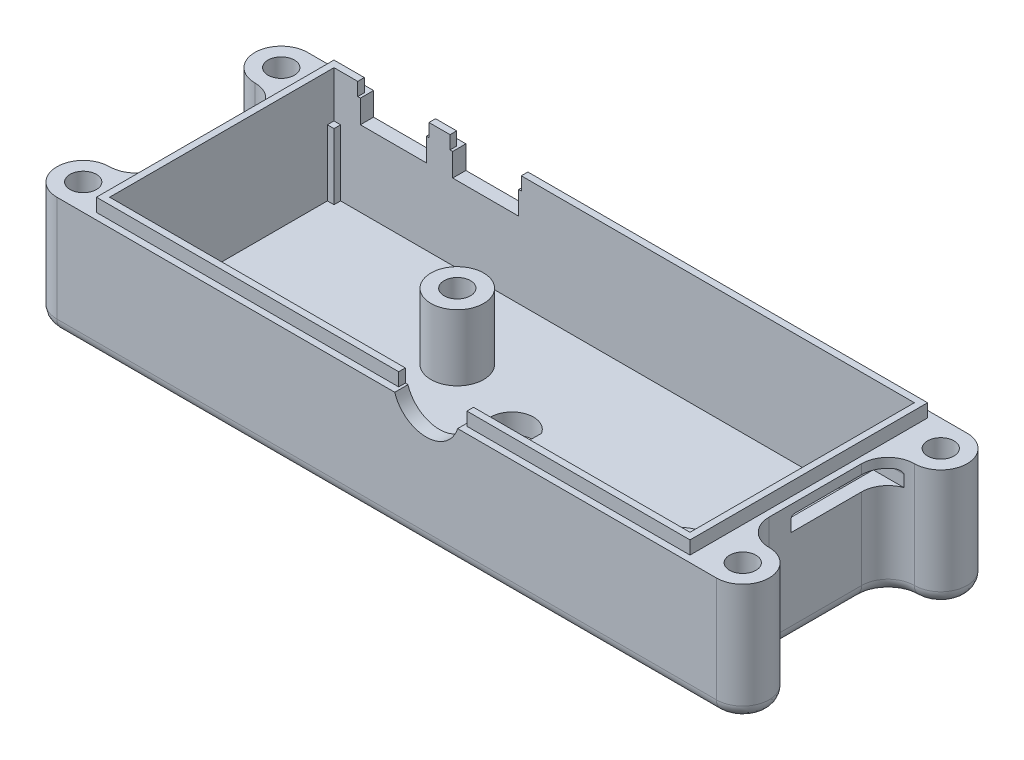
ISO-10303-21;
HEADER;
FILE_DESCRIPTION(('STEP AP214'),'2;1');
FILE_NAME('part.step','',(''),(''),'','','');
FILE_SCHEMA(('AUTOMOTIVE_DESIGN { 1 0 10303 214 1 1 1 1 }'));
ENDSEC;
DATA;
#1=APPLICATION_CONTEXT('core data for automotive mechanical design processes');
#2=APPLICATION_PROTOCOL_DEFINITION('international standard','automotive_design',2000,#1);
#3=PRODUCT_CONTEXT('',#1,'mechanical');
#4=PRODUCT('Part','Part','',(#3));
#5=PRODUCT_RELATED_PRODUCT_CATEGORY('part','',(#4));
#6=PRODUCT_DEFINITION_FORMATION('','',#4);
#7=PRODUCT_DEFINITION_CONTEXT('part definition',#1,'design');
#8=PRODUCT_DEFINITION('design','',#6,#7);
#9=PRODUCT_DEFINITION_SHAPE('','',#8);
#10=(LENGTH_UNIT() NAMED_UNIT(*) SI_UNIT(.MILLI.,.METRE.));
#11=(NAMED_UNIT(*) PLANE_ANGLE_UNIT() SI_UNIT($,.RADIAN.));
#12=(NAMED_UNIT(*) SI_UNIT($,.STERADIAN.) SOLID_ANGLE_UNIT());
#13=UNCERTAINTY_MEASURE_WITH_UNIT(LENGTH_MEASURE(1.E-05),#10,'distance_accuracy_value','');
#14=(GEOMETRIC_REPRESENTATION_CONTEXT(3) GLOBAL_UNCERTAINTY_ASSIGNED_CONTEXT((#13)) GLOBAL_UNIT_ASSIGNED_CONTEXT((#10,
#11,#12)) REPRESENTATION_CONTEXT('',''));
#15=CARTESIAN_POINT('',(0.,0.,0.));
#16=DIRECTION('',(0.,0.,1.));
#17=DIRECTION('',(1.,0.,0.));
#18=AXIS2_PLACEMENT_3D('',#15,#16,#17);
#19=CARTESIAN_POINT('',(0.,3.,0.));
#20=DIRECTION('',(0.,-1.,0.));
#21=DIRECTION('',(0.,0.,-1.));
#22=AXIS2_PLACEMENT_3D('',#19,#20,#21);
#23=PLANE('',#22);
#24=CARTESIAN_POINT('',(-12.6894142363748,3.,-4.3956467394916));
#25=DIRECTION('',(0.,-1.,0.));
#26=DIRECTION('',(0.,0.,-1.));
#27=AXIS2_PLACEMENT_3D('',#24,#25,#26);
#28=CIRCLE('',#27,2.);
#29=CARTESIAN_POINT('',(-12.6894142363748,3.,-6.39564673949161));
#30=VERTEX_POINT('',#29);
#31=EDGE_CURVE('E20',#30,#30,#28,.F.);
#32=ORIENTED_EDGE('',*,*,#31,.T.);
#33=EDGE_LOOP('',(#32));
#34=FACE_BOUND('',#33,.T.);
#35=ADVANCED_FACE('F17',(#34),#23,.F.);
#36=CARTESIAN_POINT('',(0.,3.,0.));
#37=DIRECTION('',(0.,-1.,0.));
#38=DIRECTION('',(0.,0.,-1.));
#39=AXIS2_PLACEMENT_3D('',#36,#37,#38);
#40=PLANE('',#39);
#41=CARTESIAN_POINT('',(38.4942968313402,3.,12.9124453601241));
#42=DIRECTION('',(0.,-1.,0.));
#43=DIRECTION('',(0.,0.,-1.));
#44=AXIS2_PLACEMENT_3D('',#41,#42,#43);
#45=CIRCLE('',#44,2.);
#46=CARTESIAN_POINT('',(38.4942968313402,3.,10.9124453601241));
#47=VERTEX_POINT('',#46);
#48=EDGE_CURVE('E2404',#47,#47,#45,.F.);
#49=ORIENTED_EDGE('',*,*,#48,.T.);
#50=EDGE_LOOP('',(#49));
#51=FACE_BOUND('',#50,.T.);
#52=ADVANCED_FACE('F966',(#51),#40,.F.);
#53=CARTESIAN_POINT('',(-12.6894142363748,13.,-4.3956467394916));
#54=DIRECTION('',(0.,-1.,0.));
#55=DIRECTION('',(0.,0.,-1.));
#56=AXIS2_PLACEMENT_3D('',#53,#54,#55);
#57=CYLINDRICAL_SURFACE('',#56,2.);
#58=CARTESIAN_POINT('',(-12.6894142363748,13.,-4.3956467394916));
#59=DIRECTION('',(0.,-1.,0.));
#60=DIRECTION('',(0.,0.,-1.));
#61=AXIS2_PLACEMENT_3D('',#58,#59,#60);
#62=CIRCLE('',#61,2.);
#63=CARTESIAN_POINT('',(-12.6894142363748,13.,-6.39564673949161));
#64=VERTEX_POINT('',#63);
#65=EDGE_CURVE('E622',#64,#64,#62,.T.);
#66=ORIENTED_EDGE('',*,*,#65,.F.);
#67=EDGE_LOOP('',(#66));
#68=FACE_BOUND('',#67,.T.);
#69=ORIENTED_EDGE('',*,*,#31,.F.);
#70=EDGE_LOOP('',(#69));
#71=FACE_BOUND('',#70,.T.);
#72=ADVANCED_FACE('F963',(#68,#71),#57,.F.);
#73=CARTESIAN_POINT('',(38.4942968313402,13.,12.9124453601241));
#74=DIRECTION('',(0.,-1.,0.));
#75=DIRECTION('',(0.,0.,-1.));
#76=AXIS2_PLACEMENT_3D('',#73,#74,#75);
#77=CYLINDRICAL_SURFACE('',#76,2.);
#78=CARTESIAN_POINT('',(38.4942968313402,13.,12.9124453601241));
#79=DIRECTION('',(0.,-1.,0.));
#80=DIRECTION('',(0.,0.,-1.));
#81=AXIS2_PLACEMENT_3D('',#78,#79,#80);
#82=CIRCLE('',#81,2.);
#83=CARTESIAN_POINT('',(38.4942968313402,13.,10.9124453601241));
#84=VERTEX_POINT('',#83);
#85=EDGE_CURVE('E610',#84,#84,#82,.T.);
#86=ORIENTED_EDGE('',*,*,#85,.F.);
#87=EDGE_LOOP('',(#86));
#88=FACE_BOUND('',#87,.T.);
#89=ORIENTED_EDGE('',*,*,#48,.F.);
#90=EDGE_LOOP('',(#89));
#91=FACE_BOUND('',#90,.T.);
#92=ADVANCED_FACE('F959',(#88,#91),#77,.F.);
#93=CARTESIAN_POINT('',(0.,20.,-18.01));
#94=DIRECTION('',(0.,0.,-1.));
#95=DIRECTION('',(-1.,0.,0.));
#96=AXIS2_PLACEMENT_3D('',#93,#94,#95);
#97=PLANE('',#96);
#98=DIRECTION('',(1.,0.,0.));
#99=VECTOR('',#98,1.);
#100=CARTESIAN_POINT('',(0.,20.,-18.01));
#101=LINE('',#100,#99);
#102=CARTESIAN_POINT('',(-26.4,20.,-18.01));
#103=VERTEX_POINT('',#102);
#104=CARTESIAN_POINT('',(-29.6,20.,-18.01));
#105=VERTEX_POINT('',#104);
#106=EDGE_CURVE('E702',#103,#105,#101,.F.);
#107=ORIENTED_EDGE('',*,*,#106,.F.);
#108=DIRECTION('',(0.,1.,0.));
#109=VECTOR('',#108,1.);
#110=CARTESIAN_POINT('',(-26.4,20.,-18.01));
#111=LINE('',#110,#109);
#112=CARTESIAN_POINT('',(-26.4,18.,-18.01));
#113=VERTEX_POINT('',#112);
#114=EDGE_CURVE('E708',#113,#103,#111,.T.);
#115=ORIENTED_EDGE('',*,*,#114,.F.);
#116=DIRECTION('',(1.,0.,0.));
#117=VECTOR('',#116,1.);
#118=CARTESIAN_POINT('',(0.,18.,-18.01));
#119=LINE('',#118,#117);
#120=CARTESIAN_POINT('',(-29.6,18.,-18.01));
#121=VERTEX_POINT('',#120);
#122=EDGE_CURVE('E587',#113,#121,#119,.F.);
#123=ORIENTED_EDGE('',*,*,#122,.T.);
#124=DIRECTION('',(0.,1.,0.));
#125=VECTOR('',#124,1.);
#126=CARTESIAN_POINT('',(-29.6,20.,-18.01));
#127=LINE('',#126,#125);
#128=EDGE_CURVE('E700',#121,#105,#127,.T.);
#129=ORIENTED_EDGE('',*,*,#128,.T.);
#130=EDGE_LOOP('',(#107,#115,#123,#129));
#131=FACE_BOUND('',#130,.T.);
#132=ADVANCED_FACE('F955',(#131),#97,.T.);
#133=CARTESIAN_POINT('',(54.,16.05,-10.2742989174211));
#134=DIRECTION('',(1.,0.,0.));
#135=DIRECTION('',(0.,0.,-1.));
#136=AXIS2_PLACEMENT_3D('',#133,#134,#135);
#137=CYLINDRICAL_SURFACE('',#136,0.5);
#138=DIRECTION('',(1.,0.,0.));
#139=VECTOR('',#138,1.);
#140=CARTESIAN_POINT('',(54.,16.55,-10.2742989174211));
#141=LINE('',#140,#139);
#142=CARTESIAN_POINT('',(47.6882144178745,16.55,-10.2742989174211));
#143=VERTEX_POINT('',#142);
#144=CARTESIAN_POINT('',(44.,16.55,-10.2742989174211));
#145=VERTEX_POINT('',#144);
#146=EDGE_CURVE('E567',#143,#145,#141,.F.);
#147=ORIENTED_EDGE('',*,*,#146,.T.);
#148=CARTESIAN_POINT('',(44.,16.05,-10.2742989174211));
#149=DIRECTION('',(1.,0.,0.));
#150=DIRECTION('',(0.,0.,-1.));
#151=AXIS2_PLACEMENT_3D('',#148,#149,#150);
#152=CIRCLE('',#151,0.5);
#153=CARTESIAN_POINT('',(44.,16.05,-10.7742989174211));
#154=VERTEX_POINT('',#153);
#155=EDGE_CURVE('E156',#154,#145,#152,.T.);
#156=ORIENTED_EDGE('',*,*,#155,.F.);
#157=DIRECTION('',(1.,0.,0.));
#158=VECTOR('',#157,1.);
#159=CARTESIAN_POINT('',(54.,16.05,-10.7742989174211));
#160=LINE('',#159,#158);
#161=CARTESIAN_POINT('',(48.6472052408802,16.05,-10.7742989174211));
#162=VERTEX_POINT('',#161);
#163=EDGE_CURVE('E572',#154,#162,#160,.T.);
#164=ORIENTED_EDGE('',*,*,#163,.T.);
#165=CARTESIAN_POINT('',(47.6882144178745,16.55,-10.2742989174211));
#166=CARTESIAN_POINT('',(47.7226444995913,16.5499781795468,-10.2986878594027));
#167=CARTESIAN_POINT('',(47.7574418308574,16.5482168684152,-10.3225080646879));
#168=CARTESIAN_POINT('',(47.8275445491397,16.5415335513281,-10.3688976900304));
#169=CARTESIAN_POINT('',(47.8628496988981,16.5366129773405,-10.3914676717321));
#170=CARTESIAN_POINT('',(47.934140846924,16.5238630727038,-10.4354928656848));
#171=CARTESIAN_POINT('',(47.97013010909,16.5160041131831,-10.4569340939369));
#172=CARTESIAN_POINT('',(48.0422184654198,16.4975486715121,-10.4983839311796));
#173=CARTESIAN_POINT('',(48.0783175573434,16.4869522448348,-10.51839256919));
#174=CARTESIAN_POINT('',(48.1682724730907,16.4571736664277,-10.5664720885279));
#175=CARTESIAN_POINT('',(48.2220877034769,16.436336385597,-10.5936409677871));
#176=CARTESIAN_POINT('',(48.3016568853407,16.4001247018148,-10.6316703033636));
#177=CARTESIAN_POINT('',(48.3279348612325,16.3872596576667,-10.6438704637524));
#178=CARTESIAN_POINT('',(48.3798896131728,16.3596095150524,-10.6673283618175));
#179=CARTESIAN_POINT('',(48.40556680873,16.344825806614,-10.6785867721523));
#180=CARTESIAN_POINT('',(48.4480787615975,16.3178373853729,-10.6967191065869));
#181=CARTESIAN_POINT('',(48.4651880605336,16.3062530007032,-10.7038706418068));
#182=CARTESIAN_POINT('',(48.4986833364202,16.2816760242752,-10.7176105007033));
#183=CARTESIAN_POINT('',(48.5150677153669,16.2686805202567,-10.72419760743));
#184=CARTESIAN_POINT('',(48.5467659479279,16.2408094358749,-10.7367148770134));
#185=CARTESIAN_POINT('',(48.562067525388,16.2259164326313,-10.7426378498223));
#186=CARTESIAN_POINT('',(48.5904946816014,16.1938276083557,-10.753463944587));
#187=CARTESIAN_POINT('',(48.6036282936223,16.1766407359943,-10.7583708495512));
#188=CARTESIAN_POINT('',(48.6205248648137,16.1484497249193,-10.7646088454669));
#189=CARTESIAN_POINT('',(48.6257514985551,16.138463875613,-10.7665228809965));
#190=CARTESIAN_POINT('',(48.6347229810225,16.117784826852,-10.7697927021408));
#191=CARTESIAN_POINT('',(48.6384737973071,16.1070946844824,-10.7711507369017));
#192=CARTESIAN_POINT('',(48.6432046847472,16.0886483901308,-10.7728594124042));
#193=CARTESIAN_POINT('',(48.6446863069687,16.0810377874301,-10.7733929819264));
#194=CARTESIAN_POINT('',(48.6466952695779,16.065623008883,-10.7741156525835));
#195=CARTESIAN_POINT('',(48.6472158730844,16.0578178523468,-10.7743023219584));
#196=CARTESIAN_POINT('',(48.6472052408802,16.05,-10.7742989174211));
#197=B_SPLINE_CURVE_WITH_KNOTS('',3,(#165,#166,#167,#168,#169,#170,#171,#172,#173,#174,#175,
#176,#177,#178,#179,#180,#181,#182,#183,#184,#185,#186,#187,#188,#189,#190,#191,#192,#193,#194,
#195,#196),.UNSPECIFIED.,.F.,.F.,(4,2,2,2,2,2,2,2,2,2,2,2,2,2,2,4),(0.,0.126496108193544,
0.252934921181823,0.380684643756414,0.508431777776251,0.699306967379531,0.794354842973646,
0.889334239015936,0.954882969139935,1.02056964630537,1.08691001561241,1.15299876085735,
1.18719811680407,1.22125772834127,1.24450820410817,1.26792105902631),.UNSPECIFIED.);
#198=EDGE_CURVE('E938',#143,#162,#197,.T.);
#199=ORIENTED_EDGE('',*,*,#198,.F.);
#200=EDGE_LOOP('',(#147,#156,#164,#199));
#201=FACE_BOUND('',#200,.T.);
#202=ADVANCED_FACE('F949',(#201),#137,.F.);
#203=CARTESIAN_POINT('',(54.,16.05,3.17570108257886));
#204=DIRECTION('',(1.,0.,0.));
#205=DIRECTION('',(0.,0.,-1.));
#206=AXIS2_PLACEMENT_3D('',#203,#204,#205);
#207=CYLINDRICAL_SURFACE('',#206,0.5);
#208=DIRECTION('',(1.,0.,0.));
#209=VECTOR('',#208,1.);
#210=CARTESIAN_POINT('',(54.,16.05,3.67570108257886));
#211=LINE('',#210,#209);
#212=CARTESIAN_POINT('',(46.,16.05,3.67570108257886));
#213=VERTEX_POINT('',#212);
#214=CARTESIAN_POINT('',(44.,16.05,3.67570108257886));
#215=VERTEX_POINT('',#214);
#216=EDGE_CURVE('E562',#213,#215,#211,.F.);
#217=ORIENTED_EDGE('',*,*,#216,.T.);
#218=CARTESIAN_POINT('',(44.,16.05,3.17570108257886));
#219=DIRECTION('',(1.,0.,0.));
#220=DIRECTION('',(0.,0.,-1.));
#221=AXIS2_PLACEMENT_3D('',#218,#219,#220);
#222=CIRCLE('',#221,0.5);
#223=CARTESIAN_POINT('',(44.,16.55,3.17570108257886));
#224=VERTEX_POINT('',#223);
#225=EDGE_CURVE('E936',#224,#215,#222,.T.);
#226=ORIENTED_EDGE('',*,*,#225,.F.);
#227=DIRECTION('',(1.,0.,0.));
#228=VECTOR('',#227,1.);
#229=CARTESIAN_POINT('',(54.,16.55,3.17570108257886));
#230=LINE('',#229,#228);
#231=CARTESIAN_POINT('',(46.,16.55,3.17570108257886));
#232=VERTEX_POINT('',#231);
#233=EDGE_CURVE('E569',#224,#232,#230,.T.);
#234=ORIENTED_EDGE('',*,*,#233,.T.);
#235=CARTESIAN_POINT('',(46.,16.05,3.17570108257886));
#236=DIRECTION('',(1.,0.,0.));
#237=DIRECTION('',(0.,0.,-1.));
#238=AXIS2_PLACEMENT_3D('',#235,#236,#237);
#239=CIRCLE('',#238,0.5);
#240=EDGE_CURVE('E746',#213,#232,#239,.F.);
#241=ORIENTED_EDGE('',*,*,#240,.F.);
#242=EDGE_LOOP('',(#217,#226,#234,#241));
#243=FACE_BOUND('',#242,.T.);
#244=ADVANCED_FACE('F954',(#243),#207,.F.);
#245=CARTESIAN_POINT('',(0.830303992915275,20.,0.));
#246=DIRECTION('',(1.,0.,0.));
#247=DIRECTION('',(0.,0.,-1.));
#248=AXIS2_PLACEMENT_3D('',#245,#246,#247);
#249=PLANE('',#248);
#250=DIRECTION('',(0.,0.,1.));
#251=VECTOR('',#250,1.);
#252=CARTESIAN_POINT('',(0.830303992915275,20.,0.));
#253=LINE('',#252,#251);
#254=CARTESIAN_POINT('',(0.830303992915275,20.,18.01));
#255=VERTEX_POINT('',#254);
#256=CARTESIAN_POINT('',(0.830303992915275,20.,17.01));
#257=VERTEX_POINT('',#256);
#258=EDGE_CURVE('E695',#255,#257,#253,.F.);
#259=ORIENTED_EDGE('',*,*,#258,.F.);
#260=DIRECTION('',(0.,1.,0.));
#261=VECTOR('',#260,1.);
#262=CARTESIAN_POINT('',(0.830303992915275,20.,18.01));
#263=LINE('',#262,#261);
#264=CARTESIAN_POINT('',(0.830303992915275,18.,18.01));
#265=VERTEX_POINT('',#264);
#266=EDGE_CURVE('E815',#265,#255,#263,.T.);
#267=ORIENTED_EDGE('',*,*,#266,.F.);
#268=DIRECTION('',(0.,0.,-1.));
#269=VECTOR('',#268,1.);
#270=CARTESIAN_POINT('',(0.830303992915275,18.,0.));
#271=LINE('',#270,#269);
#272=CARTESIAN_POINT('',(0.830303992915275,18.,17.01));
#273=VERTEX_POINT('',#272);
#274=EDGE_CURVE('E251',#265,#273,#271,.T.);
#275=ORIENTED_EDGE('',*,*,#274,.T.);
#276=DIRECTION('',(0.,1.,0.));
#277=VECTOR('',#276,1.);
#278=CARTESIAN_POINT('',(0.830303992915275,-94.3470211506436,17.01));
#279=LINE('',#278,#277);
#280=EDGE_CURVE('E756',#273,#257,#279,.T.);
#281=ORIENTED_EDGE('',*,*,#280,.T.);
#282=EDGE_LOOP('',(#259,#267,#275,#281));
#283=FACE_BOUND('',#282,.T.);
#284=ADVANCED_FACE('F1513',(#283),#249,.T.);
#285=CARTESIAN_POINT('',(-43.,1.5857864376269,17.01));
#286=DIRECTION('',(1.,0.,0.));
#287=DIRECTION('',(0.,0.,-1.));
#288=AXIS2_PLACEMENT_3D('',#285,#286,#287);
#289=PLANE('',#288);
#290=DIRECTION('',(0.,1.,0.));
#291=VECTOR('',#290,1.);
#292=CARTESIAN_POINT('',(-43.,1.5857864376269,16.01));
#293=LINE('',#292,#291);
#294=CARTESIAN_POINT('',(-43.,13.,16.01));
#295=VERTEX_POINT('',#294);
#296=CARTESIAN_POINT('',(-43.,3.,16.01));
#297=VERTEX_POINT('',#296);
#298=EDGE_CURVE('E718',#295,#297,#293,.F.);
#299=ORIENTED_EDGE('',*,*,#298,.F.);
#300=DIRECTION('',(0.,0.,-1.));
#301=VECTOR('',#300,1.);
#302=CARTESIAN_POINT('',(-43.,13.,0.));
#303=LINE('',#302,#301);
#304=CARTESIAN_POINT('',(-43.,13.,17.01));
#305=VERTEX_POINT('',#304);
#306=EDGE_CURVE('E721',#295,#305,#303,.F.);
#307=ORIENTED_EDGE('',*,*,#306,.T.);
#308=DIRECTION('',(0.,1.,0.));
#309=VECTOR('',#308,1.);
#310=CARTESIAN_POINT('',(-43.,-94.3470211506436,17.01));
#311=LINE('',#310,#309);
#312=CARTESIAN_POINT('',(-43.,3.,17.01));
#313=VERTEX_POINT('',#312);
#314=EDGE_CURVE('E1612',#305,#313,#311,.F.);
#315=ORIENTED_EDGE('',*,*,#314,.T.);
#316=DIRECTION('',(0.,0.,-1.));
#317=VECTOR('',#316,1.);
#318=CARTESIAN_POINT('',(-43.,3.,17.01));
#319=LINE('',#318,#317);
#320=EDGE_CURVE('E743',#313,#297,#319,.T.);
#321=ORIENTED_EDGE('',*,*,#320,.T.);
#322=EDGE_LOOP('',(#299,#307,#315,#321));
#323=FACE_BOUND('',#322,.T.);
#324=ADVANCED_FACE('F1510',(#323),#289,.T.);
#325=CARTESIAN_POINT('',(43.,1.5857864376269,17.01));
#326=DIRECTION('',(-1.,0.,0.));
#327=DIRECTION('',(0.,0.,1.));
#328=AXIS2_PLACEMENT_3D('',#325,#326,#327);
#329=PLANE('',#328);
#330=DIRECTION('',(0.,1.,0.));
#331=VECTOR('',#330,1.);
#332=CARTESIAN_POINT('',(43.,-94.3470211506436,17.01));
#333=LINE('',#332,#331);
#334=CARTESIAN_POINT('',(43.,3.,17.01));
#335=VERTEX_POINT('',#334);
#336=CARTESIAN_POINT('',(43.,13.,17.01));
#337=VERTEX_POINT('',#336);
#338=EDGE_CURVE('E1609',#335,#337,#333,.T.);
#339=ORIENTED_EDGE('',*,*,#338,.T.);
#340=DIRECTION('',(0.,0.,1.));
#341=VECTOR('',#340,1.);
#342=CARTESIAN_POINT('',(43.,13.,0.));
#343=LINE('',#342,#341);
#344=CARTESIAN_POINT('',(43.,13.,16.01));
#345=VERTEX_POINT('',#344);
#346=EDGE_CURVE('E629',#345,#337,#343,.T.);
#347=ORIENTED_EDGE('',*,*,#346,.F.);
#348=DIRECTION('',(0.,1.,0.));
#349=VECTOR('',#348,1.);
#350=CARTESIAN_POINT('',(43.,1.5857864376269,16.01));
#351=LINE('',#350,#349);
#352=CARTESIAN_POINT('',(43.,3.,16.01));
#353=VERTEX_POINT('',#352);
#354=EDGE_CURVE('E623',#353,#345,#351,.T.);
#355=ORIENTED_EDGE('',*,*,#354,.F.);
#356=DIRECTION('',(0.,0.,1.));
#357=VECTOR('',#356,1.);
#358=CARTESIAN_POINT('',(43.,3.,17.01));
#359=LINE('',#358,#357);
#360=EDGE_CURVE('E725',#353,#335,#359,.T.);
#361=ORIENTED_EDGE('',*,*,#360,.T.);
#362=EDGE_LOOP('',(#339,#347,#355,#361));
#363=FACE_BOUND('',#362,.T.);
#364=ADVANCED_FACE('F1506',(#363),#329,.T.);
#365=CARTESIAN_POINT('',(11.1696960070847,20.,0.));
#366=DIRECTION('',(1.,0.,0.));
#367=DIRECTION('',(0.,0.,-1.));
#368=AXIS2_PLACEMENT_3D('',#365,#366,#367);
#369=PLANE('',#368);
#370=DIRECTION('',(0.,1.,0.));
#371=VECTOR('',#370,1.);
#372=CARTESIAN_POINT('',(11.1696960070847,20.,18.01));
#373=LINE('',#372,#371);
#374=CARTESIAN_POINT('',(11.1696960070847,20.,18.01));
#375=VERTEX_POINT('',#374);
#376=CARTESIAN_POINT('',(11.1696960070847,18.,18.01));
#377=VERTEX_POINT('',#376);
#378=EDGE_CURVE('E548',#375,#377,#373,.F.);
#379=ORIENTED_EDGE('',*,*,#378,.F.);
#380=DIRECTION('',(0.,0.,1.));
#381=VECTOR('',#380,1.);
#382=CARTESIAN_POINT('',(11.1696960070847,20.,0.));
#383=LINE('',#382,#381);
#384=CARTESIAN_POINT('',(11.1696960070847,20.,17.01));
#385=VERTEX_POINT('',#384);
#386=EDGE_CURVE('E635',#385,#375,#383,.T.);
#387=ORIENTED_EDGE('',*,*,#386,.F.);
#388=DIRECTION('',(0.,1.,0.));
#389=VECTOR('',#388,1.);
#390=CARTESIAN_POINT('',(11.1696960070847,-94.3470211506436,17.01));
#391=LINE('',#390,#389);
#392=CARTESIAN_POINT('',(11.1696960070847,18.,17.01));
#393=VERTEX_POINT('',#392);
#394=EDGE_CURVE('E496',#385,#393,#391,.F.);
#395=ORIENTED_EDGE('',*,*,#394,.T.);
#396=DIRECTION('',(0.,0.,-1.));
#397=VECTOR('',#396,1.);
#398=CARTESIAN_POINT('',(11.1696960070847,18.,0.));
#399=LINE('',#398,#397);
#400=EDGE_CURVE('E723',#377,#393,#399,.T.);
#401=ORIENTED_EDGE('',*,*,#400,.F.);
#402=EDGE_LOOP('',(#379,#387,#395,#401));
#403=FACE_BOUND('',#402,.T.);
#404=ADVANCED_FACE('F1502',(#403),#369,.F.);
#405=CARTESIAN_POINT('',(0.,13.,0.));
#406=DIRECTION('',(0.,-1.,0.));
#407=DIRECTION('',(0.,0.,-1.));
#408=AXIS2_PLACEMENT_3D('',#405,#406,#407);
#409=PLANE('',#408);
#410=DIRECTION('',(1.,0.,0.));
#411=VECTOR('',#410,1.);
#412=CARTESIAN_POINT('',(-44.,13.,17.01));
#413=LINE('',#412,#411);
#414=CARTESIAN_POINT('',(-44.,13.,17.01));
#415=VERTEX_POINT('',#414);
#416=EDGE_CURVE('E755',#415,#305,#413,.T.);
#417=ORIENTED_EDGE('',*,*,#416,.T.);
#418=ORIENTED_EDGE('',*,*,#306,.F.);
#419=DIRECTION('',(-1.,0.,0.));
#420=VECTOR('',#419,1.);
#421=CARTESIAN_POINT('',(-44.,13.,16.01));
#422=LINE('',#421,#420);
#423=CARTESIAN_POINT('',(-44.,13.,16.01));
#424=VERTEX_POINT('',#423);
#425=EDGE_CURVE('E712',#424,#295,#422,.F.);
#426=ORIENTED_EDGE('',*,*,#425,.F.);
#427=DIRECTION('',(0.,0.,-1.));
#428=VECTOR('',#427,1.);
#429=CARTESIAN_POINT('',(-44.,13.,17.01));
#430=LINE('',#429,#428);
#431=EDGE_CURVE('E1623',#415,#424,#430,.T.);
#432=ORIENTED_EDGE('',*,*,#431,.F.);
#433=EDGE_LOOP('',(#417,#418,#426,#432));
#434=FACE_BOUND('',#433,.T.);
#435=ADVANCED_FACE('F1498',(#434),#409,.F.);
#436=CARTESIAN_POINT('',(-44.,1.5857864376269,16.01));
#437=DIRECTION('',(0.,0.,-1.));
#438=DIRECTION('',(-1.,0.,0.));
#439=AXIS2_PLACEMENT_3D('',#436,#437,#438);
#440=PLANE('',#439);
#441=DIRECTION('',(0.,1.,0.));
#442=VECTOR('',#441,1.);
#443=CARTESIAN_POINT('',(-44.,-94.3470211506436,16.01));
#444=LINE('',#443,#442);
#445=CARTESIAN_POINT('',(-44.,3.,16.01));
#446=VERTEX_POINT('',#445);
#447=EDGE_CURVE('E2309',#424,#446,#444,.F.);
#448=ORIENTED_EDGE('',*,*,#447,.F.);
#449=ORIENTED_EDGE('',*,*,#425,.T.);
#450=ORIENTED_EDGE('',*,*,#298,.T.);
#451=DIRECTION('',(-1.,0.,0.));
#452=VECTOR('',#451,1.);
#453=CARTESIAN_POINT('',(-44.,3.,16.01));
#454=LINE('',#453,#452);
#455=EDGE_CURVE('E715',#297,#446,#454,.T.);
#456=ORIENTED_EDGE('',*,*,#455,.T.);
#457=EDGE_LOOP('',(#448,#449,#450,#456));
#458=FACE_BOUND('',#457,.T.);
#459=ADVANCED_FACE('F1494',(#458),#440,.T.);
#460=CARTESIAN_POINT('',(-44.,1.5857864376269,-16.01));
#461=DIRECTION('',(0.,0.,1.));
#462=DIRECTION('',(1.,0.,0.));
#463=AXIS2_PLACEMENT_3D('',#460,#461,#462);
#464=PLANE('',#463);
#465=DIRECTION('',(0.,1.,0.));
#466=VECTOR('',#465,1.);
#467=CARTESIAN_POINT('',(-43.,1.5857864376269,-16.01));
#468=LINE('',#467,#466);
#469=CARTESIAN_POINT('',(-43.,13.,-16.01));
#470=VERTEX_POINT('',#469);
#471=CARTESIAN_POINT('',(-43.,3.,-16.01));
#472=VERTEX_POINT('',#471);
#473=EDGE_CURVE('E687',#470,#472,#468,.F.);
#474=ORIENTED_EDGE('',*,*,#473,.F.);
#475=DIRECTION('',(1.,0.,0.));
#476=VECTOR('',#475,1.);
#477=CARTESIAN_POINT('',(0.,13.,-16.01));
#478=LINE('',#477,#476);
#479=CARTESIAN_POINT('',(-44.,13.,-16.01));
#480=VERTEX_POINT('',#479);
#481=EDGE_CURVE('E690',#480,#470,#478,.T.);
#482=ORIENTED_EDGE('',*,*,#481,.F.);
#483=DIRECTION('',(0.,1.,0.));
#484=VECTOR('',#483,1.);
#485=CARTESIAN_POINT('',(-44.,-94.3470211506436,-16.01));
#486=LINE('',#485,#484);
#487=CARTESIAN_POINT('',(-44.,3.,-16.01));
#488=VERTEX_POINT('',#487);
#489=EDGE_CURVE('E2306',#488,#480,#486,.T.);
#490=ORIENTED_EDGE('',*,*,#489,.F.);
#491=DIRECTION('',(1.,0.,0.));
#492=VECTOR('',#491,1.);
#493=CARTESIAN_POINT('',(-44.,3.,-16.01));
#494=LINE('',#493,#492);
#495=EDGE_CURVE('E710',#488,#472,#494,.T.);
#496=ORIENTED_EDGE('',*,*,#495,.T.);
#497=EDGE_LOOP('',(#474,#482,#490,#496));
#498=FACE_BOUND('',#497,.T.);
#499=ADVANCED_FACE('F1490',(#498),#464,.T.);
#500=CARTESIAN_POINT('',(-26.4,20.,0.));
#501=DIRECTION('',(1.,0.,0.));
#502=DIRECTION('',(0.,0.,-1.));
#503=AXIS2_PLACEMENT_3D('',#500,#501,#502);
#504=PLANE('',#503);
#505=DIRECTION('',(0.,0.,1.));
#506=VECTOR('',#505,1.);
#507=CARTESIAN_POINT('',(-26.4,20.,0.));
#508=LINE('',#507,#506);
#509=CARTESIAN_POINT('',(-26.4,20.,-17.01));
#510=VERTEX_POINT('',#509);
#511=EDGE_CURVE('E705',#510,#103,#508,.F.);
#512=ORIENTED_EDGE('',*,*,#511,.F.);
#513=DIRECTION('',(0.,1.,0.));
#514=VECTOR('',#513,1.);
#515=CARTESIAN_POINT('',(-26.4,-94.3470211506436,-17.01));
#516=LINE('',#515,#514);
#517=CARTESIAN_POINT('',(-26.4,18.,-17.01));
#518=VERTEX_POINT('',#517);
#519=EDGE_CURVE('E781',#518,#510,#516,.T.);
#520=ORIENTED_EDGE('',*,*,#519,.F.);
#521=DIRECTION('',(0.,0.,-1.));
#522=VECTOR('',#521,1.);
#523=CARTESIAN_POINT('',(-26.4,18.,0.));
#524=LINE('',#523,#522);
#525=EDGE_CURVE('E596',#518,#113,#524,.T.);
#526=ORIENTED_EDGE('',*,*,#525,.T.);
#527=ORIENTED_EDGE('',*,*,#114,.T.);
#528=EDGE_LOOP('',(#512,#520,#526,#527));
#529=FACE_BOUND('',#528,.T.);
#530=ADVANCED_FACE('F1486',(#529),#504,.T.);
#531=CARTESIAN_POINT('',(0.,20.,0.));
#532=DIRECTION('',(0.,1.,0.));
#533=DIRECTION('',(0.,0.,1.));
#534=AXIS2_PLACEMENT_3D('',#531,#532,#533);
#535=PLANE('',#534);
#536=DIRECTION('',(0.,0.,-1.));
#537=VECTOR('',#536,1.);
#538=CARTESIAN_POINT('',(-29.6,20.,0.));
#539=LINE('',#538,#537);
#540=CARTESIAN_POINT('',(-29.6,20.,-17.01));
#541=VERTEX_POINT('',#540);
#542=EDGE_CURVE('E698',#105,#541,#539,.F.);
#543=ORIENTED_EDGE('',*,*,#542,.T.);
#544=DIRECTION('',(1.,0.,0.));
#545=VECTOR('',#544,1.);
#546=CARTESIAN_POINT('',(-44.,20.,-17.01));
#547=LINE('',#546,#545);
#548=EDGE_CURVE('E2297',#510,#541,#547,.F.);
#549=ORIENTED_EDGE('',*,*,#548,.F.);
#550=ORIENTED_EDGE('',*,*,#511,.T.);
#551=ORIENTED_EDGE('',*,*,#106,.T.);
#552=EDGE_LOOP('',(#543,#549,#550,#551));
#553=FACE_BOUND('',#552,.T.);
#554=ADVANCED_FACE('F1482',(#553),#535,.T.);
#555=CARTESIAN_POINT('',(-29.6,20.,0.));
#556=DIRECTION('',(1.,0.,0.));
#557=DIRECTION('',(0.,0.,-1.));
#558=AXIS2_PLACEMENT_3D('',#555,#556,#557);
#559=PLANE('',#558);
#560=DIRECTION('',(0.,1.,0.));
#561=VECTOR('',#560,1.);
#562=CARTESIAN_POINT('',(-29.6,-94.3470211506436,-17.01));
#563=LINE('',#562,#561);
#564=CARTESIAN_POINT('',(-29.6,18.,-17.01));
#565=VERTEX_POINT('',#564);
#566=EDGE_CURVE('E775',#541,#565,#563,.F.);
#567=ORIENTED_EDGE('',*,*,#566,.F.);
#568=ORIENTED_EDGE('',*,*,#542,.F.);
#569=ORIENTED_EDGE('',*,*,#128,.F.);
#570=DIRECTION('',(0.,0.,-1.));
#571=VECTOR('',#570,1.);
#572=CARTESIAN_POINT('',(-29.6,18.,0.));
#573=LINE('',#572,#571);
#574=EDGE_CURVE('E600',#121,#565,#573,.F.);
#575=ORIENTED_EDGE('',*,*,#574,.T.);
#576=EDGE_LOOP('',(#567,#568,#569,#575));
#577=FACE_BOUND('',#576,.T.);
#578=ADVANCED_FACE('F1478',(#577),#559,.F.);
#579=CARTESIAN_POINT('',(-40.4,20.,0.));
#580=DIRECTION('',(1.,0.,0.));
#581=DIRECTION('',(0.,0.,-1.));
#582=AXIS2_PLACEMENT_3D('',#579,#580,#581);
#583=PLANE('',#582);
#584=DIRECTION('',(0.,0.,1.));
#585=VECTOR('',#584,1.);
#586=CARTESIAN_POINT('',(-40.4,20.,0.));
#587=LINE('',#586,#585);
#588=CARTESIAN_POINT('',(-40.4,20.,-17.01));
#589=VERTEX_POINT('',#588);
#590=CARTESIAN_POINT('',(-40.4,20.,-18.01));
#591=VERTEX_POINT('',#590);
#592=EDGE_CURVE('E693',#589,#591,#587,.F.);
#593=ORIENTED_EDGE('',*,*,#592,.F.);
#594=DIRECTION('',(0.,1.,0.));
#595=VECTOR('',#594,1.);
#596=CARTESIAN_POINT('',(-40.4,-94.3470211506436,-17.01));
#597=LINE('',#596,#595);
#598=CARTESIAN_POINT('',(-40.4,18.,-17.01));
#599=VERTEX_POINT('',#598);
#600=EDGE_CURVE('E760',#599,#589,#597,.T.);
#601=ORIENTED_EDGE('',*,*,#600,.F.);
#602=DIRECTION('',(0.,0.,-1.));
#603=VECTOR('',#602,1.);
#604=CARTESIAN_POINT('',(-40.4,18.,0.));
#605=LINE('',#604,#603);
#606=CARTESIAN_POINT('',(-40.4,18.,-18.01));
#607=VERTEX_POINT('',#606);
#608=EDGE_CURVE('E696',#599,#607,#605,.T.);
#609=ORIENTED_EDGE('',*,*,#608,.T.);
#610=DIRECTION('',(0.,1.,0.));
#611=VECTOR('',#610,1.);
#612=CARTESIAN_POINT('',(-40.4,20.,-18.01));
#613=LINE('',#612,#611);
#614=EDGE_CURVE('E1531',#591,#607,#613,.F.);
#615=ORIENTED_EDGE('',*,*,#614,.F.);
#616=EDGE_LOOP('',(#593,#601,#609,#615));
#617=FACE_BOUND('',#616,.T.);
#618=ADVANCED_FACE('F1474',(#617),#583,.T.);
#619=CARTESIAN_POINT('',(0.,20.,0.));
#620=DIRECTION('',(0.,1.,0.));
#621=DIRECTION('',(0.,0.,1.));
#622=AXIS2_PLACEMENT_3D('',#619,#620,#621);
#623=PLANE('',#622);
#624=DIRECTION('',(0.,0.,1.));
#625=VECTOR('',#624,1.);
#626=CARTESIAN_POINT('',(-45.,20.,0.));
#627=LINE('',#626,#625);
#628=CARTESIAN_POINT('',(-45.,20.,18.01));
#629=VERTEX_POINT('',#628);
#630=CARTESIAN_POINT('',(-45.,20.,-18.01));
#631=VERTEX_POINT('',#630);
#632=EDGE_CURVE('E1523',#629,#631,#627,.F.);
#633=ORIENTED_EDGE('',*,*,#632,.F.);
#634=DIRECTION('',(1.,0.,0.));
#635=VECTOR('',#634,1.);
#636=CARTESIAN_POINT('',(0.,20.,18.01));
#637=LINE('',#636,#635);
#638=EDGE_CURVE('E811',#255,#629,#637,.F.);
#639=ORIENTED_EDGE('',*,*,#638,.F.);
#640=ORIENTED_EDGE('',*,*,#258,.T.);
#641=DIRECTION('',(1.,0.,0.));
#642=VECTOR('',#641,1.);
#643=CARTESIAN_POINT('',(-44.,20.,17.01));
#644=LINE('',#643,#642);
#645=CARTESIAN_POINT('',(-44.,20.,17.01));
#646=VERTEX_POINT('',#645);
#647=EDGE_CURVE('E753',#257,#646,#644,.F.);
#648=ORIENTED_EDGE('',*,*,#647,.T.);
#649=DIRECTION('',(0.,0.,-1.));
#650=VECTOR('',#649,1.);
#651=CARTESIAN_POINT('',(-44.,20.,17.01));
#652=LINE('',#651,#650);
#653=CARTESIAN_POINT('',(-44.,20.,-17.01));
#654=VERTEX_POINT('',#653);
#655=EDGE_CURVE('E787',#654,#646,#652,.F.);
#656=ORIENTED_EDGE('',*,*,#655,.F.);
#657=DIRECTION('',(1.,0.,0.));
#658=VECTOR('',#657,1.);
#659=CARTESIAN_POINT('',(-44.,20.,-17.01));
#660=LINE('',#659,#658);
#661=EDGE_CURVE('E1538',#589,#654,#660,.F.);
#662=ORIENTED_EDGE('',*,*,#661,.F.);
#663=ORIENTED_EDGE('',*,*,#592,.T.);
#664=DIRECTION('',(-1.,0.,0.));
#665=VECTOR('',#664,1.);
#666=CARTESIAN_POINT('',(0.,20.,-18.01));
#667=LINE('',#666,#665);
#668=EDGE_CURVE('E465',#631,#591,#667,.F.);
#669=ORIENTED_EDGE('',*,*,#668,.F.);
#670=EDGE_LOOP('',(#633,#639,#640,#648,#656,#662,#663,#669));
#671=FACE_BOUND('',#670,.T.);
#672=ADVANCED_FACE('F1470',(#671),#623,.T.);
#673=CARTESIAN_POINT('',(0.,13.,0.));
#674=DIRECTION('',(0.,1.,0.));
#675=DIRECTION('',(0.,0.,1.));
#676=AXIS2_PLACEMENT_3D('',#673,#674,#675);
#677=PLANE('',#676);
#678=DIRECTION('',(0.,0.,-1.));
#679=VECTOR('',#678,1.);
#680=CARTESIAN_POINT('',(-43.,13.,-17.01));
#681=LINE('',#680,#679);
#682=CARTESIAN_POINT('',(-43.,13.,-17.01));
#683=VERTEX_POINT('',#682);
#684=EDGE_CURVE('E681',#683,#470,#681,.F.);
#685=ORIENTED_EDGE('',*,*,#684,.F.);
#686=DIRECTION('',(1.,0.,0.));
#687=VECTOR('',#686,1.);
#688=CARTESIAN_POINT('',(-44.,13.,-17.01));
#689=LINE('',#688,#687);
#690=CARTESIAN_POINT('',(-44.,13.,-17.01));
#691=VERTEX_POINT('',#690);
#692=EDGE_CURVE('E2288',#691,#683,#689,.T.);
#693=ORIENTED_EDGE('',*,*,#692,.F.);
#694=DIRECTION('',(0.,0.,-1.));
#695=VECTOR('',#694,1.);
#696=CARTESIAN_POINT('',(-44.,13.,17.01));
#697=LINE('',#696,#695);
#698=EDGE_CURVE('E2304',#480,#691,#697,.T.);
#699=ORIENTED_EDGE('',*,*,#698,.F.);
#700=ORIENTED_EDGE('',*,*,#481,.T.);
#701=EDGE_LOOP('',(#685,#693,#699,#700));
#702=FACE_BOUND('',#701,.T.);
#703=ADVANCED_FACE('F1466',(#702),#677,.T.);
#704=CARTESIAN_POINT('',(-43.,1.5857864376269,-17.01));
#705=DIRECTION('',(1.,0.,0.));
#706=DIRECTION('',(0.,0.,-1.));
#707=AXIS2_PLACEMENT_3D('',#704,#705,#706);
#708=PLANE('',#707);
#709=DIRECTION('',(0.,1.,0.));
#710=VECTOR('',#709,1.);
#711=CARTESIAN_POINT('',(-43.,-94.3470211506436,-17.01));
#712=LINE('',#711,#710);
#713=CARTESIAN_POINT('',(-43.,3.,-17.01));
#714=VERTEX_POINT('',#713);
#715=EDGE_CURVE('E2285',#683,#714,#712,.F.);
#716=ORIENTED_EDGE('',*,*,#715,.F.);
#717=ORIENTED_EDGE('',*,*,#684,.T.);
#718=ORIENTED_EDGE('',*,*,#473,.T.);
#719=DIRECTION('',(0.,0.,-1.));
#720=VECTOR('',#719,1.);
#721=CARTESIAN_POINT('',(-43.,3.,-17.01));
#722=LINE('',#721,#720);
#723=EDGE_CURVE('E684',#472,#714,#722,.T.);
#724=ORIENTED_EDGE('',*,*,#723,.T.);
#725=EDGE_LOOP('',(#716,#717,#718,#724));
#726=FACE_BOUND('',#725,.T.);
#727=ADVANCED_FACE('F1462',(#726),#708,.T.);
#728=CARTESIAN_POINT('',(43.,1.5857864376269,-17.01));
#729=DIRECTION('',(-1.,0.,0.));
#730=DIRECTION('',(0.,0.,1.));
#731=AXIS2_PLACEMENT_3D('',#728,#729,#730);
#732=PLANE('',#731);
#733=DIRECTION('',(0.,1.,0.));
#734=VECTOR('',#733,1.);
#735=CARTESIAN_POINT('',(43.,1.5857864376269,-16.01));
#736=LINE('',#735,#734);
#737=CARTESIAN_POINT('',(43.,13.,-16.01));
#738=VERTEX_POINT('',#737);
#739=CARTESIAN_POINT('',(43.,3.,-16.01));
#740=VERTEX_POINT('',#739);
#741=EDGE_CURVE('E642',#738,#740,#736,.F.);
#742=ORIENTED_EDGE('',*,*,#741,.F.);
#743=DIRECTION('',(0.,0.,-1.));
#744=VECTOR('',#743,1.);
#745=CARTESIAN_POINT('',(43.,13.,0.));
#746=LINE('',#745,#744);
#747=CARTESIAN_POINT('',(43.,13.,-17.01));
#748=VERTEX_POINT('',#747);
#749=EDGE_CURVE('E633',#738,#748,#746,.T.);
#750=ORIENTED_EDGE('',*,*,#749,.T.);
#751=DIRECTION('',(0.,1.,0.));
#752=VECTOR('',#751,1.);
#753=CARTESIAN_POINT('',(43.,-94.3470211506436,-17.01));
#754=LINE('',#753,#752);
#755=CARTESIAN_POINT('',(43.,3.,-17.01));
#756=VERTEX_POINT('',#755);
#757=EDGE_CURVE('E2282',#756,#748,#754,.T.);
#758=ORIENTED_EDGE('',*,*,#757,.F.);
#759=DIRECTION('',(0.,0.,1.));
#760=VECTOR('',#759,1.);
#761=CARTESIAN_POINT('',(43.,3.,-17.01));
#762=LINE('',#761,#760);
#763=EDGE_CURVE('E658',#756,#740,#762,.T.);
#764=ORIENTED_EDGE('',*,*,#763,.T.);
#765=EDGE_LOOP('',(#742,#750,#758,#764));
#766=FACE_BOUND('',#765,.T.);
#767=ADVANCED_FACE('F1458',(#766),#732,.T.);
#768=CARTESIAN_POINT('',(-15.6,20.,0.));
#769=DIRECTION('',(1.,0.,0.));
#770=DIRECTION('',(0.,0.,-1.));
#771=AXIS2_PLACEMENT_3D('',#768,#769,#770);
#772=PLANE('',#771);
#773=DIRECTION('',(0.,1.,0.));
#774=VECTOR('',#773,1.);
#775=CARTESIAN_POINT('',(-15.6,-94.3470211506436,-17.01));
#776=LINE('',#775,#774);
#777=CARTESIAN_POINT('',(-15.6,20.,-17.01));
#778=VERTEX_POINT('',#777);
#779=CARTESIAN_POINT('',(-15.6,18.,-17.01));
#780=VERTEX_POINT('',#779);
#781=EDGE_CURVE('E529',#778,#780,#776,.F.);
#782=ORIENTED_EDGE('',*,*,#781,.F.);
#783=DIRECTION('',(0.,0.,1.));
#784=VECTOR('',#783,1.);
#785=CARTESIAN_POINT('',(-15.6,20.,0.));
#786=LINE('',#785,#784);
#787=CARTESIAN_POINT('',(-15.6,20.,-18.01));
#788=VERTEX_POINT('',#787);
#789=EDGE_CURVE('E632',#788,#778,#786,.T.);
#790=ORIENTED_EDGE('',*,*,#789,.F.);
#791=DIRECTION('',(0.,1.,0.));
#792=VECTOR('',#791,1.);
#793=CARTESIAN_POINT('',(-15.6,20.,-18.01));
#794=LINE('',#793,#792);
#795=CARTESIAN_POINT('',(-15.6,18.,-18.01));
#796=VERTEX_POINT('',#795);
#797=EDGE_CURVE('E544',#796,#788,#794,.T.);
#798=ORIENTED_EDGE('',*,*,#797,.F.);
#799=DIRECTION('',(0.,0.,-1.));
#800=VECTOR('',#799,1.);
#801=CARTESIAN_POINT('',(-15.6,18.,0.));
#802=LINE('',#801,#800);
#803=EDGE_CURVE('E645',#780,#796,#802,.T.);
#804=ORIENTED_EDGE('',*,*,#803,.F.);
#805=EDGE_LOOP('',(#782,#790,#798,#804));
#806=FACE_BOUND('',#805,.T.);
#807=ADVANCED_FACE('F1454',(#806),#772,.F.);
#808=CARTESIAN_POINT('',(44.,1.5857864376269,-16.01));
#809=DIRECTION('',(0.,0.,1.));
#810=DIRECTION('',(1.,0.,0.));
#811=AXIS2_PLACEMENT_3D('',#808,#809,#810);
#812=PLANE('',#811);
#813=DIRECTION('',(0.,1.,0.));
#814=VECTOR('',#813,1.);
#815=CARTESIAN_POINT('',(44.,-94.3470211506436,-16.01));
#816=LINE('',#815,#814);
#817=CARTESIAN_POINT('',(44.,3.,-16.01));
#818=VERTEX_POINT('',#817);
#819=CARTESIAN_POINT('',(44.,13.,-16.01));
#820=VERTEX_POINT('',#819);
#821=EDGE_CURVE('E2268',#818,#820,#816,.T.);
#822=ORIENTED_EDGE('',*,*,#821,.T.);
#823=DIRECTION('',(1.,0.,0.));
#824=VECTOR('',#823,1.);
#825=CARTESIAN_POINT('',(0.,13.,-16.01));
#826=LINE('',#825,#824);
#827=EDGE_CURVE('E636',#820,#738,#826,.F.);
#828=ORIENTED_EDGE('',*,*,#827,.T.);
#829=ORIENTED_EDGE('',*,*,#741,.T.);
#830=DIRECTION('',(1.,0.,0.));
#831=VECTOR('',#830,1.);
#832=CARTESIAN_POINT('',(44.,3.,-16.01));
#833=LINE('',#832,#831);
#834=EDGE_CURVE('E639',#740,#818,#833,.T.);
#835=ORIENTED_EDGE('',*,*,#834,.T.);
#836=EDGE_LOOP('',(#822,#828,#829,#835));
#837=FACE_BOUND('',#836,.T.);
#838=ADVANCED_FACE('F1450',(#837),#812,.T.);
#839=CARTESIAN_POINT('',(0.,13.,0.));
#840=DIRECTION('',(0.,-1.,0.));
#841=DIRECTION('',(0.,0.,-1.));
#842=AXIS2_PLACEMENT_3D('',#839,#840,#841);
#843=PLANE('',#842);
#844=DIRECTION('',(1.,0.,0.));
#845=VECTOR('',#844,1.);
#846=CARTESIAN_POINT('',(-44.,13.,-17.01));
#847=LINE('',#846,#845);
#848=CARTESIAN_POINT('',(44.,13.,-17.01));
#849=VERTEX_POINT('',#848);
#850=EDGE_CURVE('E663',#748,#849,#847,.T.);
#851=ORIENTED_EDGE('',*,*,#850,.F.);
#852=ORIENTED_EDGE('',*,*,#749,.F.);
#853=ORIENTED_EDGE('',*,*,#827,.F.);
#854=DIRECTION('',(0.,0.,-1.));
#855=VECTOR('',#854,1.);
#856=CARTESIAN_POINT('',(44.,13.,17.01));
#857=LINE('',#856,#855);
#858=EDGE_CURVE('E673',#820,#849,#857,.T.);
#859=ORIENTED_EDGE('',*,*,#858,.T.);
#860=EDGE_LOOP('',(#851,#852,#853,#859));
#861=FACE_BOUND('',#860,.T.);
#862=ADVANCED_FACE('F1446',(#861),#843,.F.);
#863=CARTESIAN_POINT('',(0.,20.,0.));
#864=DIRECTION('',(0.,1.,0.));
#865=DIRECTION('',(0.,0.,1.));
#866=AXIS2_PLACEMENT_3D('',#863,#864,#865);
#867=PLANE('',#866);
#868=DIRECTION('',(1.,0.,0.));
#869=VECTOR('',#868,1.);
#870=CARTESIAN_POINT('',(-44.,20.,-17.01));
#871=LINE('',#870,#869);
#872=CARTESIAN_POINT('',(44.,20.,-17.01));
#873=VERTEX_POINT('',#872);
#874=EDGE_CURVE('E534',#873,#778,#871,.F.);
#875=ORIENTED_EDGE('',*,*,#874,.F.);
#876=DIRECTION('',(0.,0.,-1.));
#877=VECTOR('',#876,1.);
#878=CARTESIAN_POINT('',(44.,20.,17.01));
#879=LINE('',#878,#877);
#880=CARTESIAN_POINT('',(44.,20.,17.01));
#881=VERTEX_POINT('',#880);
#882=EDGE_CURVE('E672',#873,#881,#879,.F.);
#883=ORIENTED_EDGE('',*,*,#882,.T.);
#884=DIRECTION('',(1.,0.,0.));
#885=VECTOR('',#884,1.);
#886=CARTESIAN_POINT('',(-44.,20.,17.01));
#887=LINE('',#886,#885);
#888=EDGE_CURVE('E500',#881,#385,#887,.F.);
#889=ORIENTED_EDGE('',*,*,#888,.T.);
#890=ORIENTED_EDGE('',*,*,#386,.T.);
#891=DIRECTION('',(1.,0.,0.));
#892=VECTOR('',#891,1.);
#893=CARTESIAN_POINT('',(0.,20.,18.01));
#894=LINE('',#893,#892);
#895=CARTESIAN_POINT('',(45.,20.,18.01));
#896=VERTEX_POINT('',#895);
#897=EDGE_CURVE('E557',#896,#375,#894,.F.);
#898=ORIENTED_EDGE('',*,*,#897,.F.);
#899=DIRECTION('',(0.,0.,-1.));
#900=VECTOR('',#899,1.);
#901=CARTESIAN_POINT('',(45.,20.,0.));
#902=LINE('',#901,#900);
#903=CARTESIAN_POINT('',(45.,20.,-18.01));
#904=VERTEX_POINT('',#903);
#905=EDGE_CURVE('E545',#904,#896,#902,.F.);
#906=ORIENTED_EDGE('',*,*,#905,.F.);
#907=DIRECTION('',(-1.,0.,0.));
#908=VECTOR('',#907,1.);
#909=CARTESIAN_POINT('',(0.,20.,-18.01));
#910=LINE('',#909,#908);
#911=EDGE_CURVE('E540',#788,#904,#910,.F.);
#912=ORIENTED_EDGE('',*,*,#911,.F.);
#913=ORIENTED_EDGE('',*,*,#789,.T.);
#914=EDGE_LOOP('',(#875,#883,#889,#890,#898,#906,#912,#913));
#915=FACE_BOUND('',#914,.T.);
#916=ADVANCED_FACE('F1442',(#915),#867,.T.);
#917=CARTESIAN_POINT('',(0.,13.,0.));
#918=DIRECTION('',(0.,1.,0.));
#919=DIRECTION('',(0.,0.,1.));
#920=AXIS2_PLACEMENT_3D('',#917,#918,#919);
#921=PLANE('',#920);
#922=ORIENTED_EDGE('',*,*,#346,.T.);
#923=DIRECTION('',(1.,0.,0.));
#924=VECTOR('',#923,1.);
#925=CARTESIAN_POINT('',(-44.,13.,17.01));
#926=LINE('',#925,#924);
#927=CARTESIAN_POINT('',(44.,13.,17.01));
#928=VERTEX_POINT('',#927);
#929=EDGE_CURVE('E730',#337,#928,#926,.T.);
#930=ORIENTED_EDGE('',*,*,#929,.T.);
#931=DIRECTION('',(0.,0.,-1.));
#932=VECTOR('',#931,1.);
#933=CARTESIAN_POINT('',(44.,13.,17.01));
#934=LINE('',#933,#932);
#935=CARTESIAN_POINT('',(44.,13.,16.01));
#936=VERTEX_POINT('',#935);
#937=EDGE_CURVE('E738',#928,#936,#934,.T.);
#938=ORIENTED_EDGE('',*,*,#937,.T.);
#939=DIRECTION('',(-1.,0.,0.));
#940=VECTOR('',#939,1.);
#941=CARTESIAN_POINT('',(44.,13.,16.01));
#942=LINE('',#941,#940);
#943=EDGE_CURVE('E619',#345,#936,#942,.F.);
#944=ORIENTED_EDGE('',*,*,#943,.F.);
#945=EDGE_LOOP('',(#922,#930,#938,#944));
#946=FACE_BOUND('',#945,.T.);
#947=ADVANCED_FACE('F1438',(#946),#921,.T.);
#948=CARTESIAN_POINT('',(44.,1.5857864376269,16.01));
#949=DIRECTION('',(0.,0.,-1.));
#950=DIRECTION('',(-1.,0.,0.));
#951=AXIS2_PLACEMENT_3D('',#948,#949,#950);
#952=PLANE('',#951);
#953=ORIENTED_EDGE('',*,*,#354,.T.);
#954=ORIENTED_EDGE('',*,*,#943,.T.);
#955=DIRECTION('',(0.,1.,0.));
#956=VECTOR('',#955,1.);
#957=CARTESIAN_POINT('',(44.,-94.3470211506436,16.01));
#958=LINE('',#957,#956);
#959=CARTESIAN_POINT('',(44.,3.,16.01));
#960=VERTEX_POINT('',#959);
#961=EDGE_CURVE('E928',#936,#960,#958,.F.);
#962=ORIENTED_EDGE('',*,*,#961,.T.);
#963=DIRECTION('',(-1.,0.,0.));
#964=VECTOR('',#963,1.);
#965=CARTESIAN_POINT('',(44.,3.,16.01));
#966=LINE('',#965,#964);
#967=EDGE_CURVE('E626',#960,#353,#966,.T.);
#968=ORIENTED_EDGE('',*,*,#967,.T.);
#969=EDGE_LOOP('',(#953,#954,#962,#968));
#970=FACE_BOUND('',#969,.T.);
#971=ADVANCED_FACE('F1434',(#970),#952,.T.);
#972=CARTESIAN_POINT('',(-12.6894142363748,13.,-4.3956467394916));
#973=DIRECTION('',(0.,1.,0.));
#974=DIRECTION('',(0.,0.,1.));
#975=AXIS2_PLACEMENT_3D('',#972,#973,#974);
#976=PLANE('',#975);
#977=ORIENTED_EDGE('',*,*,#65,.T.);
#978=EDGE_LOOP('',(#977));
#979=FACE_BOUND('',#978,.T.);
#980=CARTESIAN_POINT('',(-12.6894142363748,13.,-4.3956467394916));
#981=DIRECTION('',(0.,-1.,0.));
#982=DIRECTION('',(0.,0.,-1.));
#983=AXIS2_PLACEMENT_3D('',#980,#981,#982);
#984=CIRCLE('',#983,4.);
#985=CARTESIAN_POINT('',(-12.6894142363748,13.,-8.3956467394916));
#986=VERTEX_POINT('',#985);
#987=EDGE_CURVE('E925',#986,#986,#984,.T.);
#988=ORIENTED_EDGE('',*,*,#987,.F.);
#989=EDGE_LOOP('',(#988));
#990=FACE_BOUND('',#989,.T.);
#991=ADVANCED_FACE('F1430',(#979,#990),#976,.T.);
#992=CARTESIAN_POINT('',(38.4942968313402,13.,12.9124453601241));
#993=DIRECTION('',(0.,1.,0.));
#994=DIRECTION('',(0.,0.,1.));
#995=AXIS2_PLACEMENT_3D('',#992,#993,#994);
#996=PLANE('',#995);
#997=ORIENTED_EDGE('',*,*,#85,.T.);
#998=EDGE_LOOP('',(#997));
#999=FACE_BOUND('',#998,.T.);
#1000=CARTESIAN_POINT('',(38.4942968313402,13.,12.9124453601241));
#1001=DIRECTION('',(0.,-1.,0.));
#1002=DIRECTION('',(0.,0.,-1.));
#1003=AXIS2_PLACEMENT_3D('',#1000,#1001,#1002);
#1004=CIRCLE('',#1003,4.);
#1005=CARTESIAN_POINT('',(38.4942968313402,13.,8.91244536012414));
#1006=VERTEX_POINT('',#1005);
#1007=EDGE_CURVE('E511',#1006,#1006,#1004,.T.);
#1008=ORIENTED_EDGE('',*,*,#1007,.F.);
#1009=EDGE_LOOP('',(#1008));
#1010=FACE_BOUND('',#1009,.T.);
#1011=ADVANCED_FACE('F1426',(#999,#1010),#996,.T.);
#1012=CARTESIAN_POINT('',(-26.,14.5,-19.01));
#1013=DIRECTION('',(0.,-1.,0.));
#1014=DIRECTION('',(0.,0.,-1.));
#1015=AXIS2_PLACEMENT_3D('',#1012,#1013,#1014);
#1016=PLANE('',#1015);
#1017=DIRECTION('',(0.,0.,-1.));
#1018=VECTOR('',#1017,1.);
#1019=CARTESIAN_POINT('',(-16.,14.5,-19.01));
#1020=LINE('',#1019,#1018);
#1021=CARTESIAN_POINT('',(-16.,14.5,-17.01));
#1022=VERTEX_POINT('',#1021);
#1023=CARTESIAN_POINT('',(-16.,14.5,-19.01));
#1024=VERTEX_POINT('',#1023);
#1025=EDGE_CURVE('E171',#1022,#1024,#1020,.T.);
#1026=ORIENTED_EDGE('',*,*,#1025,.T.);
#1027=DIRECTION('',(1.,0.,0.));
#1028=VECTOR('',#1027,1.);
#1029=CARTESIAN_POINT('',(-46.,14.5,-19.01));
#1030=LINE('',#1029,#1028);
#1031=CARTESIAN_POINT('',(-26.,14.5,-19.01));
#1032=VERTEX_POINT('',#1031);
#1033=EDGE_CURVE('E510',#1024,#1032,#1030,.F.);
#1034=ORIENTED_EDGE('',*,*,#1033,.T.);
#1035=DIRECTION('',(0.,0.,1.));
#1036=VECTOR('',#1035,1.);
#1037=CARTESIAN_POINT('',(-26.,14.5,-19.01));
#1038=LINE('',#1037,#1036);
#1039=CARTESIAN_POINT('',(-26.,14.5,-17.01));
#1040=VERTEX_POINT('',#1039);
#1041=EDGE_CURVE('E602',#1032,#1040,#1038,.T.);
#1042=ORIENTED_EDGE('',*,*,#1041,.T.);
#1043=DIRECTION('',(1.,0.,0.));
#1044=VECTOR('',#1043,1.);
#1045=CARTESIAN_POINT('',(-44.,14.5,-17.01));
#1046=LINE('',#1045,#1044);
#1047=EDGE_CURVE('E528',#1022,#1040,#1046,.F.);
#1048=ORIENTED_EDGE('',*,*,#1047,.F.);
#1049=EDGE_LOOP('',(#1026,#1034,#1042,#1048));
#1050=FACE_BOUND('',#1049,.T.);
#1051=ADVANCED_FACE('F1422',(#1050),#1016,.F.);
#1052=CARTESIAN_POINT('',(-26.,14.5,-19.01));
#1053=DIRECTION('',(-1.,0.,0.));
#1054=DIRECTION('',(0.,0.,1.));
#1055=AXIS2_PLACEMENT_3D('',#1052,#1053,#1054);
#1056=PLANE('',#1055);
#1057=ORIENTED_EDGE('',*,*,#1041,.F.);
#1058=DIRECTION('',(0.,1.,0.));
#1059=VECTOR('',#1058,1.);
#1060=CARTESIAN_POINT('',(-26.,18.,-19.01));
#1061=LINE('',#1060,#1059);
#1062=CARTESIAN_POINT('',(-26.,18.,-19.01));
#1063=VERTEX_POINT('',#1062);
#1064=EDGE_CURVE('E591',#1032,#1063,#1061,.T.);
#1065=ORIENTED_EDGE('',*,*,#1064,.T.);
#1066=DIRECTION('',(0.,0.,-1.));
#1067=VECTOR('',#1066,1.);
#1068=CARTESIAN_POINT('',(-26.,18.,0.));
#1069=LINE('',#1068,#1067);
#1070=CARTESIAN_POINT('',(-26.,18.,-17.01));
#1071=VERTEX_POINT('',#1070);
#1072=EDGE_CURVE('E599',#1063,#1071,#1069,.F.);
#1073=ORIENTED_EDGE('',*,*,#1072,.T.);
#1074=DIRECTION('',(0.,1.,0.));
#1075=VECTOR('',#1074,1.);
#1076=CARTESIAN_POINT('',(-26.,-94.3470211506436,-17.01));
#1077=LINE('',#1076,#1075);
#1078=EDGE_CURVE('E782',#1040,#1071,#1077,.T.);
#1079=ORIENTED_EDGE('',*,*,#1078,.F.);
#1080=EDGE_LOOP('',(#1057,#1065,#1073,#1079));
#1081=FACE_BOUND('',#1080,.T.);
#1082=ADVANCED_FACE('F1418',(#1081),#1056,.F.);
#1083=CARTESIAN_POINT('',(0.,18.,0.));
#1084=DIRECTION('',(0.,-1.,0.));
#1085=DIRECTION('',(0.,0.,-1.));
#1086=AXIS2_PLACEMENT_3D('',#1083,#1084,#1085);
#1087=PLANE('',#1086);
#1088=ORIENTED_EDGE('',*,*,#525,.F.);
#1089=DIRECTION('',(1.,0.,0.));
#1090=VECTOR('',#1089,1.);
#1091=CARTESIAN_POINT('',(-44.,18.,-17.01));
#1092=LINE('',#1091,#1090);
#1093=EDGE_CURVE('E778',#1071,#518,#1092,.F.);
#1094=ORIENTED_EDGE('',*,*,#1093,.F.);
#1095=ORIENTED_EDGE('',*,*,#1072,.F.);
#1096=DIRECTION('',(1.,0.,0.));
#1097=VECTOR('',#1096,1.);
#1098=CARTESIAN_POINT('',(-46.,18.,-19.01));
#1099=LINE('',#1098,#1097);
#1100=CARTESIAN_POINT('',(-30.,18.,-19.01));
#1101=VERTEX_POINT('',#1100);
#1102=EDGE_CURVE('E583',#1063,#1101,#1099,.F.);
#1103=ORIENTED_EDGE('',*,*,#1102,.T.);
#1104=DIRECTION('',(0.,0.,-1.));
#1105=VECTOR('',#1104,1.);
#1106=CARTESIAN_POINT('',(-30.,18.,-19.01));
#1107=LINE('',#1106,#1105);
#1108=CARTESIAN_POINT('',(-30.,18.,-17.01));
#1109=VERTEX_POINT('',#1108);
#1110=EDGE_CURVE('E579',#1101,#1109,#1107,.F.);
#1111=ORIENTED_EDGE('',*,*,#1110,.T.);
#1112=DIRECTION('',(1.,0.,0.));
#1113=VECTOR('',#1112,1.);
#1114=CARTESIAN_POINT('',(-44.,18.,-17.01));
#1115=LINE('',#1114,#1113);
#1116=EDGE_CURVE('E770',#565,#1109,#1115,.F.);
#1117=ORIENTED_EDGE('',*,*,#1116,.F.);
#1118=ORIENTED_EDGE('',*,*,#574,.F.);
#1119=ORIENTED_EDGE('',*,*,#122,.F.);
#1120=EDGE_LOOP('',(#1088,#1094,#1095,#1103,#1111,#1117,#1118,#1119));
#1121=FACE_BOUND('',#1120,.T.);
#1122=ADVANCED_FACE('F1414',(#1121),#1087,.F.);
#1123=CARTESIAN_POINT('',(-30.,14.5,-19.01));
#1124=DIRECTION('',(1.,0.,0.));
#1125=DIRECTION('',(0.,0.,-1.));
#1126=AXIS2_PLACEMENT_3D('',#1123,#1124,#1125);
#1127=PLANE('',#1126);
#1128=ORIENTED_EDGE('',*,*,#1110,.F.);
#1129=DIRECTION('',(0.,1.,0.));
#1130=VECTOR('',#1129,1.);
#1131=CARTESIAN_POINT('',(-30.,18.,-19.01));
#1132=LINE('',#1131,#1130);
#1133=CARTESIAN_POINT('',(-30.,14.5,-19.01));
#1134=VERTEX_POINT('',#1133);
#1135=EDGE_CURVE('E457',#1101,#1134,#1132,.F.);
#1136=ORIENTED_EDGE('',*,*,#1135,.T.);
#1137=DIRECTION('',(0.,0.,-1.));
#1138=VECTOR('',#1137,1.);
#1139=CARTESIAN_POINT('',(-30.,14.5,-19.01));
#1140=LINE('',#1139,#1138);
#1141=CARTESIAN_POINT('',(-30.,14.5,-17.01));
#1142=VERTEX_POINT('',#1141);
#1143=EDGE_CURVE('E452',#1134,#1142,#1140,.F.);
#1144=ORIENTED_EDGE('',*,*,#1143,.T.);
#1145=DIRECTION('',(0.,1.,0.));
#1146=VECTOR('',#1145,1.);
#1147=CARTESIAN_POINT('',(-30.,-94.3470211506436,-17.01));
#1148=LINE('',#1147,#1146);
#1149=EDGE_CURVE('E765',#1109,#1142,#1148,.F.);
#1150=ORIENTED_EDGE('',*,*,#1149,.F.);
#1151=EDGE_LOOP('',(#1128,#1136,#1144,#1150));
#1152=FACE_BOUND('',#1151,.T.);
#1153=ADVANCED_FACE('F1411',(#1152),#1127,.F.);
#1154=CARTESIAN_POINT('',(-40.,14.5,-19.01));
#1155=DIRECTION('',(0.,-1.,0.));
#1156=DIRECTION('',(0.,0.,-1.));
#1157=AXIS2_PLACEMENT_3D('',#1154,#1155,#1156);
#1158=PLANE('',#1157);
#1159=ORIENTED_EDGE('',*,*,#1143,.F.);
#1160=DIRECTION('',(1.,0.,0.));
#1161=VECTOR('',#1160,1.);
#1162=CARTESIAN_POINT('',(-46.,14.5,-19.01));
#1163=LINE('',#1162,#1161);
#1164=CARTESIAN_POINT('',(-40.,14.5,-19.01));
#1165=VERTEX_POINT('',#1164);
#1166=EDGE_CURVE('E446',#1134,#1165,#1163,.F.);
#1167=ORIENTED_EDGE('',*,*,#1166,.T.);
#1168=DIRECTION('',(0.,0.,1.));
#1169=VECTOR('',#1168,1.);
#1170=CARTESIAN_POINT('',(-40.,14.5,-19.01));
#1171=LINE('',#1170,#1169);
#1172=CARTESIAN_POINT('',(-40.,14.5,-17.01));
#1173=VERTEX_POINT('',#1172);
#1174=EDGE_CURVE('E450',#1165,#1173,#1171,.T.);
#1175=ORIENTED_EDGE('',*,*,#1174,.T.);
#1176=DIRECTION('',(1.,0.,0.));
#1177=VECTOR('',#1176,1.);
#1178=CARTESIAN_POINT('',(-44.,14.5,-17.01));
#1179=LINE('',#1178,#1177);
#1180=EDGE_CURVE('E761',#1142,#1173,#1179,.F.);
#1181=ORIENTED_EDGE('',*,*,#1180,.F.);
#1182=EDGE_LOOP('',(#1159,#1167,#1175,#1181));
#1183=FACE_BOUND('',#1182,.T.);
#1184=ADVANCED_FACE('F448',(#1183),#1158,.F.);
#1185=CARTESIAN_POINT('',(54.,14.3,-10.7742989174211));
#1186=DIRECTION('',(0.,0.,-1.));
#1187=DIRECTION('',(0.,1.,0.));
#1188=AXIS2_PLACEMENT_3D('',#1185,#1186,#1187);
#1189=PLANE('',#1188);
#1190=ORIENTED_EDGE('',*,*,#163,.F.);
#1191=DIRECTION('',(0.,1.,0.));
#1192=VECTOR('',#1191,1.);
#1193=CARTESIAN_POINT('',(44.,-94.3470211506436,-10.7742989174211));
#1194=LINE('',#1193,#1192);
#1195=CARTESIAN_POINT('',(44.,14.3,-10.7742989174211));
#1196=VERTEX_POINT('',#1195);
#1197=EDGE_CURVE('E650',#154,#1196,#1194,.F.);
#1198=ORIENTED_EDGE('',*,*,#1197,.T.);
#1199=DIRECTION('',(1.,0.,0.));
#1200=VECTOR('',#1199,1.);
#1201=CARTESIAN_POINT('',(54.,14.3,-10.7742989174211));
#1202=LINE('',#1201,#1200);
#1203=CARTESIAN_POINT('',(48.6472052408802,14.3,-10.7742989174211));
#1204=VERTEX_POINT('',#1203);
#1205=EDGE_CURVE('E555',#1196,#1204,#1202,.T.);
#1206=ORIENTED_EDGE('',*,*,#1205,.T.);
#1207=DIRECTION('',(0.,1.,0.));
#1208=VECTOR('',#1207,1.);
#1209=CARTESIAN_POINT('',(48.6472052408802,29.3137084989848,-10.7742989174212));
#1210=LINE('',#1209,#1208);
#1211=EDGE_CURVE('E918',#1204,#162,#1210,.T.);
#1212=ORIENTED_EDGE('',*,*,#1211,.T.);
#1213=EDGE_LOOP('',(#1190,#1198,#1206,#1212));
#1214=FACE_BOUND('',#1213,.T.);
#1215=ADVANCED_FACE('F1405',(#1214),#1189,.F.);
#1216=CARTESIAN_POINT('',(54.,16.55,3.67570108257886));
#1217=DIRECTION('',(0.,1.,0.));
#1218=DIRECTION('',(0.,0.,1.));
#1219=AXIS2_PLACEMENT_3D('',#1216,#1217,#1218);
#1220=PLANE('',#1219);
#1221=ORIENTED_EDGE('',*,*,#146,.F.);
#1222=CARTESIAN_POINT('',(50.,16.55,-7.00999999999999));
#1223=DIRECTION('',(0.,1.,0.));
#1224=DIRECTION('',(0.,0.,1.));
#1225=AXIS2_PLACEMENT_3D('',#1222,#1223,#1224);
#1226=CIRCLE('',#1225,4.);
#1227=CARTESIAN_POINT('',(46.,16.55,-7.00999999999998));
#1228=VERTEX_POINT('',#1227);
#1229=EDGE_CURVE('E507',#143,#1228,#1226,.T.);
#1230=ORIENTED_EDGE('',*,*,#1229,.T.);
#1231=DIRECTION('',(0.,0.,1.));
#1232=VECTOR('',#1231,1.);
#1233=CARTESIAN_POINT('',(46.,16.55,19.01));
#1234=LINE('',#1233,#1232);
#1235=EDGE_CURVE('E506',#1228,#232,#1234,.T.);
#1236=ORIENTED_EDGE('',*,*,#1235,.T.);
#1237=ORIENTED_EDGE('',*,*,#233,.F.);
#1238=DIRECTION('',(0.,0.,-1.));
#1239=VECTOR('',#1238,1.);
#1240=CARTESIAN_POINT('',(44.,16.55,17.01));
#1241=LINE('',#1240,#1239);
#1242=EDGE_CURVE('E2270',#224,#145,#1241,.T.);
#1243=ORIENTED_EDGE('',*,*,#1242,.T.);
#1244=EDGE_LOOP('',(#1221,#1230,#1236,#1237,#1243));
#1245=FACE_BOUND('',#1244,.T.);
#1246=ADVANCED_FACE('F1401',(#1245),#1220,.F.);
#1247=CARTESIAN_POINT('',(54.,14.3,3.67570108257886));
#1248=DIRECTION('',(0.,0.,1.));
#1249=DIRECTION('',(1.,0.,0.));
#1250=AXIS2_PLACEMENT_3D('',#1247,#1248,#1249);
#1251=PLANE('',#1250);
#1252=ORIENTED_EDGE('',*,*,#216,.F.);
#1253=DIRECTION('',(0.,1.,0.));
#1254=VECTOR('',#1253,1.);
#1255=CARTESIAN_POINT('',(46.,18.,3.67570108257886));
#1256=LINE('',#1255,#1254);
#1257=CARTESIAN_POINT('',(46.,14.3,3.67570108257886));
#1258=VERTEX_POINT('',#1257);
#1259=EDGE_CURVE('E552',#213,#1258,#1256,.F.);
#1260=ORIENTED_EDGE('',*,*,#1259,.T.);
#1261=DIRECTION('',(1.,0.,0.));
#1262=VECTOR('',#1261,1.);
#1263=CARTESIAN_POINT('',(54.,14.3,3.67570108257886));
#1264=LINE('',#1263,#1262);
#1265=CARTESIAN_POINT('',(44.,14.3,3.67570108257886));
#1266=VERTEX_POINT('',#1265);
#1267=EDGE_CURVE('E558',#1258,#1266,#1264,.F.);
#1268=ORIENTED_EDGE('',*,*,#1267,.T.);
#1269=DIRECTION('',(0.,1.,0.));
#1270=VECTOR('',#1269,1.);
#1271=CARTESIAN_POINT('',(44.,-94.3470211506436,3.67570108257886));
#1272=LINE('',#1271,#1270);
#1273=EDGE_CURVE('E649',#1266,#215,#1272,.T.);
#1274=ORIENTED_EDGE('',*,*,#1273,.T.);
#1275=EDGE_LOOP('',(#1252,#1260,#1268,#1274));
#1276=FACE_BOUND('',#1275,.T.);
#1277=ADVANCED_FACE('F1398',(#1276),#1251,.F.);
#1278=CARTESIAN_POINT('',(54.,14.3,3.67570108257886));
#1279=DIRECTION('',(0.,-1.,0.));
#1280=DIRECTION('',(0.,0.,-1.));
#1281=AXIS2_PLACEMENT_3D('',#1278,#1279,#1280);
#1282=PLANE('',#1281);
#1283=ORIENTED_EDGE('',*,*,#1205,.F.);
#1284=DIRECTION('',(0.,0.,-1.));
#1285=VECTOR('',#1284,1.);
#1286=CARTESIAN_POINT('',(44.,14.3,17.01));
#1287=LINE('',#1286,#1285);
#1288=EDGE_CURVE('E646',#1196,#1266,#1287,.F.);
#1289=ORIENTED_EDGE('',*,*,#1288,.T.);
#1290=ORIENTED_EDGE('',*,*,#1267,.F.);
#1291=DIRECTION('',(0.,0.,1.));
#1292=VECTOR('',#1291,1.);
#1293=CARTESIAN_POINT('',(46.,14.3,19.01));
#1294=LINE('',#1293,#1292);
#1295=CARTESIAN_POINT('',(46.,14.3,-7.00999999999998));
#1296=VERTEX_POINT('',#1295);
#1297=EDGE_CURVE('E549',#1258,#1296,#1294,.F.);
#1298=ORIENTED_EDGE('',*,*,#1297,.T.);
#1299=CARTESIAN_POINT('',(50.,14.3,-7.00999999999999));
#1300=DIRECTION('',(0.,1.,0.));
#1301=DIRECTION('',(0.,0.,1.));
#1302=AXIS2_PLACEMENT_3D('',#1299,#1300,#1301);
#1303=CIRCLE('',#1302,4.);
#1304=EDGE_CURVE('E919',#1296,#1204,#1303,.F.);
#1305=ORIENTED_EDGE('',*,*,#1304,.T.);
#1306=EDGE_LOOP('',(#1283,#1289,#1290,#1298,#1305));
#1307=FACE_BOUND('',#1306,.T.);
#1308=ADVANCED_FACE('F1299',(#1307),#1282,.F.);
#1309=CARTESIAN_POINT('',(0.,20.,18.01));
#1310=DIRECTION('',(0.,0.,1.));
#1311=DIRECTION('',(1.,0.,0.));
#1312=AXIS2_PLACEMENT_3D('',#1309,#1310,#1311);
#1313=PLANE('',#1312);
#1314=ORIENTED_EDGE('',*,*,#897,.T.);
#1315=ORIENTED_EDGE('',*,*,#378,.T.);
#1316=DIRECTION('',(1.,0.,0.));
#1317=VECTOR('',#1316,1.);
#1318=CARTESIAN_POINT('',(0.,18.,18.01));
#1319=LINE('',#1318,#1317);
#1320=CARTESIAN_POINT('',(45.,18.,18.01));
#1321=VERTEX_POINT('',#1320);
#1322=EDGE_CURVE('E823',#377,#1321,#1319,.T.);
#1323=ORIENTED_EDGE('',*,*,#1322,.T.);
#1324=DIRECTION('',(0.,1.,0.));
#1325=VECTOR('',#1324,1.);
#1326=CARTESIAN_POINT('',(45.,20.,18.01));
#1327=LINE('',#1326,#1325);
#1328=EDGE_CURVE('E541',#896,#1321,#1327,.F.);
#1329=ORIENTED_EDGE('',*,*,#1328,.F.);
#1330=EDGE_LOOP('',(#1314,#1315,#1323,#1329));
#1331=FACE_BOUND('',#1330,.T.);
#1332=ADVANCED_FACE('F1391',(#1331),#1313,.T.);
#1333=CARTESIAN_POINT('',(45.,20.,0.));
#1334=DIRECTION('',(1.,0.,0.));
#1335=DIRECTION('',(0.,0.,-1.));
#1336=AXIS2_PLACEMENT_3D('',#1333,#1334,#1335);
#1337=PLANE('',#1336);
#1338=ORIENTED_EDGE('',*,*,#905,.T.);
#1339=ORIENTED_EDGE('',*,*,#1328,.T.);
#1340=DIRECTION('',(0.,0.,-1.));
#1341=VECTOR('',#1340,1.);
#1342=CARTESIAN_POINT('',(45.,18.,0.));
#1343=LINE('',#1342,#1341);
#1344=CARTESIAN_POINT('',(45.,18.,-18.01));
#1345=VERTEX_POINT('',#1344);
#1346=EDGE_CURVE('E808',#1321,#1345,#1343,.T.);
#1347=ORIENTED_EDGE('',*,*,#1346,.T.);
#1348=DIRECTION('',(0.,1.,0.));
#1349=VECTOR('',#1348,1.);
#1350=CARTESIAN_POINT('',(45.,20.,-18.01));
#1351=LINE('',#1350,#1349);
#1352=EDGE_CURVE('E537',#904,#1345,#1351,.F.);
#1353=ORIENTED_EDGE('',*,*,#1352,.F.);
#1354=EDGE_LOOP('',(#1338,#1339,#1347,#1353));
#1355=FACE_BOUND('',#1354,.T.);
#1356=ADVANCED_FACE('F1387',(#1355),#1337,.T.);
#1357=CARTESIAN_POINT('',(0.,20.,-18.01));
#1358=DIRECTION('',(0.,0.,-1.));
#1359=DIRECTION('',(-1.,0.,0.));
#1360=AXIS2_PLACEMENT_3D('',#1357,#1358,#1359);
#1361=PLANE('',#1360);
#1362=ORIENTED_EDGE('',*,*,#911,.T.);
#1363=ORIENTED_EDGE('',*,*,#1352,.T.);
#1364=DIRECTION('',(1.,0.,0.));
#1365=VECTOR('',#1364,1.);
#1366=CARTESIAN_POINT('',(0.,18.,-18.01));
#1367=LINE('',#1366,#1365);
#1368=EDGE_CURVE('E522',#1345,#796,#1367,.F.);
#1369=ORIENTED_EDGE('',*,*,#1368,.T.);
#1370=ORIENTED_EDGE('',*,*,#797,.T.);
#1371=EDGE_LOOP('',(#1362,#1363,#1369,#1370));
#1372=FACE_BOUND('',#1371,.T.);
#1373=ADVANCED_FACE('F1384',(#1372),#1361,.T.);
#1374=CARTESIAN_POINT('',(-16.,14.5,-19.01));
#1375=DIRECTION('',(1.,0.,0.));
#1376=DIRECTION('',(0.,0.,-1.));
#1377=AXIS2_PLACEMENT_3D('',#1374,#1375,#1376);
#1378=PLANE('',#1377);
#1379=DIRECTION('',(0.,0.,-1.));
#1380=VECTOR('',#1379,1.);
#1381=CARTESIAN_POINT('',(-16.,18.,0.));
#1382=LINE('',#1381,#1380);
#1383=CARTESIAN_POINT('',(-16.,18.,-17.01));
#1384=VERTEX_POINT('',#1383);
#1385=CARTESIAN_POINT('',(-16.,18.,-19.01));
#1386=VERTEX_POINT('',#1385);
#1387=EDGE_CURVE('E514',#1384,#1386,#1382,.T.);
#1388=ORIENTED_EDGE('',*,*,#1387,.T.);
#1389=DIRECTION('',(0.,1.,0.));
#1390=VECTOR('',#1389,1.);
#1391=CARTESIAN_POINT('',(-16.,18.,-19.01));
#1392=LINE('',#1391,#1390);
#1393=EDGE_CURVE('E508',#1386,#1024,#1392,.F.);
#1394=ORIENTED_EDGE('',*,*,#1393,.T.);
#1395=ORIENTED_EDGE('',*,*,#1025,.F.);
#1396=DIRECTION('',(0.,1.,0.));
#1397=VECTOR('',#1396,1.);
#1398=CARTESIAN_POINT('',(-16.,-94.3470211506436,-17.01));
#1399=LINE('',#1398,#1397);
#1400=EDGE_CURVE('E525',#1384,#1022,#1399,.F.);
#1401=ORIENTED_EDGE('',*,*,#1400,.F.);
#1402=EDGE_LOOP('',(#1388,#1394,#1395,#1401));
#1403=FACE_BOUND('',#1402,.T.);
#1404=ADVANCED_FACE('F1380',(#1403),#1378,.F.);
#1405=CARTESIAN_POINT('',(50.,29.3137084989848,-15.01));
#1406=DIRECTION('',(0.,-1.,0.));
#1407=DIRECTION('',(0.,0.,-1.));
#1408=AXIS2_PLACEMENT_3D('',#1405,#1406,#1407);
#1409=CYLINDRICAL_SURFACE('',#1408,4.);
#1410=DIRECTION('',(0.,1.,0.));
#1411=VECTOR('',#1410,1.);
#1412=CARTESIAN_POINT('',(50.,18.,-19.01));
#1413=LINE('',#1412,#1411);
#1414=CARTESIAN_POINT('',(50.,2.,-19.01));
#1415=VERTEX_POINT('',#1414);
#1416=CARTESIAN_POINT('',(50.,18.,-19.01));
#1417=VERTEX_POINT('',#1416);
#1418=EDGE_CURVE('E475',#1415,#1417,#1413,.T.);
#1419=ORIENTED_EDGE('',*,*,#1418,.T.);
#1420=CARTESIAN_POINT('',(50.,18.,-15.01));
#1421=DIRECTION('',(0.,-1.,0.));
#1422=DIRECTION('',(0.,0.,-1.));
#1423=AXIS2_PLACEMENT_3D('',#1420,#1421,#1422);
#1424=CIRCLE('',#1423,4.);
#1425=CARTESIAN_POINT('',(50.,18.,-11.01));
#1426=VERTEX_POINT('',#1425);
#1427=EDGE_CURVE('E915',#1417,#1426,#1424,.T.);
#1428=ORIENTED_EDGE('',*,*,#1427,.T.);
#1429=DIRECTION('',(0.,1.,0.));
#1430=VECTOR('',#1429,1.);
#1431=CARTESIAN_POINT('',(50.,29.3137084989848,-11.01));
#1432=LINE('',#1431,#1430);
#1433=CARTESIAN_POINT('',(50.,2.,-11.01));
#1434=VERTEX_POINT('',#1433);
#1435=EDGE_CURVE('E922',#1426,#1434,#1432,.F.);
#1436=ORIENTED_EDGE('',*,*,#1435,.T.);
#1437=CARTESIAN_POINT('',(50.,2.,-15.01));
#1438=DIRECTION('',(0.,-1.,0.));
#1439=DIRECTION('',(0.,0.,-1.));
#1440=AXIS2_PLACEMENT_3D('',#1437,#1438,#1439);
#1441=CIRCLE('',#1440,4.);
#1442=EDGE_CURVE('E1312',#1415,#1434,#1441,.T.);
#1443=ORIENTED_EDGE('',*,*,#1442,.F.);
#1444=EDGE_LOOP('',(#1419,#1428,#1436,#1443));
#1445=FACE_BOUND('',#1444,.T.);
#1446=ADVANCED_FACE('F1376',(#1445),#1409,.T.);
#1447=CARTESIAN_POINT('',(50.,29.3137084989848,15.01));
#1448=DIRECTION('',(0.,-1.,0.));
#1449=DIRECTION('',(0.,0.,-1.));
#1450=AXIS2_PLACEMENT_3D('',#1447,#1448,#1449);
#1451=CYLINDRICAL_SURFACE('',#1450,3.99999999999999);
#1452=DIRECTION('',(0.,-1.,0.));
#1453=VECTOR('',#1452,1.);
#1454=CARTESIAN_POINT('',(50.,18.,11.01));
#1455=LINE('',#1454,#1453);
#1456=CARTESIAN_POINT('',(50.,2.,11.01));
#1457=VERTEX_POINT('',#1456);
#1458=CARTESIAN_POINT('',(50.,18.,11.01));
#1459=VERTEX_POINT('',#1458);
#1460=EDGE_CURVE('E825',#1457,#1459,#1455,.F.);
#1461=ORIENTED_EDGE('',*,*,#1460,.T.);
#1462=CARTESIAN_POINT('',(50.,18.,15.01));
#1463=DIRECTION('',(0.,-1.,0.));
#1464=DIRECTION('',(0.,0.,-1.));
#1465=AXIS2_PLACEMENT_3D('',#1462,#1463,#1464);
#1466=CIRCLE('',#1465,3.99999999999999);
#1467=CARTESIAN_POINT('',(50.,18.,19.01));
#1468=VERTEX_POINT('',#1467);
#1469=EDGE_CURVE('E490',#1459,#1468,#1466,.T.);
#1470=ORIENTED_EDGE('',*,*,#1469,.T.);
#1471=DIRECTION('',(0.,1.,0.));
#1472=VECTOR('',#1471,1.);
#1473=CARTESIAN_POINT('',(50.,18.,19.01));
#1474=LINE('',#1473,#1472);
#1475=CARTESIAN_POINT('',(50.,2.,19.01));
#1476=VERTEX_POINT('',#1475);
#1477=EDGE_CURVE('E1259',#1468,#1476,#1474,.F.);
#1478=ORIENTED_EDGE('',*,*,#1477,.T.);
#1479=CARTESIAN_POINT('',(50.,2.,15.01));
#1480=DIRECTION('',(0.,-1.,0.));
#1481=DIRECTION('',(0.,0.,-1.));
#1482=AXIS2_PLACEMENT_3D('',#1479,#1480,#1481);
#1483=CIRCLE('',#1482,3.99999999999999);
#1484=EDGE_CURVE('E493',#1457,#1476,#1483,.T.);
#1485=ORIENTED_EDGE('',*,*,#1484,.F.);
#1486=EDGE_LOOP('',(#1461,#1470,#1478,#1485));
#1487=FACE_BOUND('',#1486,.T.);
#1488=ADVANCED_FACE('F1372',(#1487),#1451,.T.);
#1489=CARTESIAN_POINT('',(6.,19.5,19.01));
#1490=DIRECTION('',(0.,0.,-1.));
#1491=DIRECTION('',(-1.,0.,0.));
#1492=AXIS2_PLACEMENT_3D('',#1489,#1490,#1491);
#1493=CYLINDRICAL_SURFACE('',#1492,5.);
#1494=CARTESIAN_POINT('',(6.,19.5,19.01));
#1495=DIRECTION('',(0.,0.,-1.));
#1496=DIRECTION('',(-1.,0.,0.));
#1497=AXIS2_PLACEMENT_3D('',#1494,#1495,#1496);
#1498=CIRCLE('',#1497,5.);
#1499=CARTESIAN_POINT('',(1.23030399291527,18.,19.01));
#1500=VERTEX_POINT('',#1499);
#1501=CARTESIAN_POINT('',(10.7696960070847,18.,19.01));
#1502=VERTEX_POINT('',#1501);
#1503=EDGE_CURVE('E904',#1500,#1502,#1498,.F.);
#1504=ORIENTED_EDGE('',*,*,#1503,.T.);
#1505=DIRECTION('',(0.,0.,-1.));
#1506=VECTOR('',#1505,1.);
#1507=CARTESIAN_POINT('',(10.7696960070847,18.,0.));
#1508=LINE('',#1507,#1506);
#1509=CARTESIAN_POINT('',(10.7696960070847,18.,17.01));
#1510=VERTEX_POINT('',#1509);
#1511=EDGE_CURVE('E487',#1502,#1510,#1508,.T.);
#1512=ORIENTED_EDGE('',*,*,#1511,.T.);
#1513=CARTESIAN_POINT('',(6.,19.5,17.01));
#1514=DIRECTION('',(0.,0.,-1.));
#1515=DIRECTION('',(-1.,0.,0.));
#1516=AXIS2_PLACEMENT_3D('',#1513,#1514,#1515);
#1517=CIRCLE('',#1516,5.);
#1518=CARTESIAN_POINT('',(1.23030399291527,18.,17.01));
#1519=VERTEX_POINT('',#1518);
#1520=EDGE_CURVE('E499',#1510,#1519,#1517,.T.);
#1521=ORIENTED_EDGE('',*,*,#1520,.T.);
#1522=DIRECTION('',(0.,0.,-1.));
#1523=VECTOR('',#1522,1.);
#1524=CARTESIAN_POINT('',(1.23030399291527,18.,0.));
#1525=LINE('',#1524,#1523);
#1526=EDGE_CURVE('E1252',#1519,#1500,#1525,.F.);
#1527=ORIENTED_EDGE('',*,*,#1526,.T.);
#1528=EDGE_LOOP('',(#1504,#1512,#1521,#1527));
#1529=FACE_BOUND('',#1528,.T.);
#1530=ADVANCED_FACE('F1369',(#1529),#1493,.F.);
#1531=CARTESIAN_POINT('',(-40.,14.5,-19.01));
#1532=DIRECTION('',(-1.,0.,0.));
#1533=DIRECTION('',(0.,0.,1.));
#1534=AXIS2_PLACEMENT_3D('',#1531,#1532,#1533);
#1535=PLANE('',#1534);
#1536=ORIENTED_EDGE('',*,*,#1174,.F.);
#1537=DIRECTION('',(0.,1.,0.));
#1538=VECTOR('',#1537,1.);
#1539=CARTESIAN_POINT('',(-40.,18.,-19.01));
#1540=LINE('',#1539,#1538);
#1541=CARTESIAN_POINT('',(-40.,18.,-19.01));
#1542=VERTEX_POINT('',#1541);
#1543=EDGE_CURVE('E456',#1165,#1542,#1540,.T.);
#1544=ORIENTED_EDGE('',*,*,#1543,.T.);
#1545=DIRECTION('',(0.,0.,-1.));
#1546=VECTOR('',#1545,1.);
#1547=CARTESIAN_POINT('',(-40.,18.,0.));
#1548=LINE('',#1547,#1546);
#1549=CARTESIAN_POINT('',(-40.,18.,-17.01));
#1550=VERTEX_POINT('',#1549);
#1551=EDGE_CURVE('E482',#1542,#1550,#1548,.F.);
#1552=ORIENTED_EDGE('',*,*,#1551,.T.);
#1553=DIRECTION('',(0.,1.,0.));
#1554=VECTOR('',#1553,1.);
#1555=CARTESIAN_POINT('',(-40.,-94.3470211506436,-17.01));
#1556=LINE('',#1555,#1554);
#1557=EDGE_CURVE('E463',#1173,#1550,#1556,.T.);
#1558=ORIENTED_EDGE('',*,*,#1557,.F.);
#1559=EDGE_LOOP('',(#1536,#1544,#1552,#1558));
#1560=FACE_BOUND('',#1559,.T.);
#1561=ADVANCED_FACE('F460',(#1560),#1535,.F.);
#1562=CARTESIAN_POINT('',(0.,20.,-18.01));
#1563=DIRECTION('',(0.,0.,-1.));
#1564=DIRECTION('',(-1.,0.,0.));
#1565=AXIS2_PLACEMENT_3D('',#1562,#1563,#1564);
#1566=PLANE('',#1565);
#1567=ORIENTED_EDGE('',*,*,#668,.T.);
#1568=ORIENTED_EDGE('',*,*,#614,.T.);
#1569=DIRECTION('',(1.,0.,0.));
#1570=VECTOR('',#1569,1.);
#1571=CARTESIAN_POINT('',(0.,18.,-18.01));
#1572=LINE('',#1571,#1570);
#1573=CARTESIAN_POINT('',(-45.,18.,-18.01));
#1574=VERTEX_POINT('',#1573);
#1575=EDGE_CURVE('E1243',#607,#1574,#1572,.F.);
#1576=ORIENTED_EDGE('',*,*,#1575,.T.);
#1577=DIRECTION('',(0.,1.,0.));
#1578=VECTOR('',#1577,1.);
#1579=CARTESIAN_POINT('',(-45.,20.,-18.01));
#1580=LINE('',#1579,#1578);
#1581=EDGE_CURVE('E820',#631,#1574,#1580,.F.);
#1582=ORIENTED_EDGE('',*,*,#1581,.F.);
#1583=EDGE_LOOP('',(#1567,#1568,#1576,#1582));
#1584=FACE_BOUND('',#1583,.T.);
#1585=ADVANCED_FACE('F1363',(#1584),#1566,.T.);
#1586=CARTESIAN_POINT('',(-45.,20.,0.));
#1587=DIRECTION('',(-1.,0.,0.));
#1588=DIRECTION('',(0.,0.,1.));
#1589=AXIS2_PLACEMENT_3D('',#1586,#1587,#1588);
#1590=PLANE('',#1589);
#1591=ORIENTED_EDGE('',*,*,#632,.T.);
#1592=ORIENTED_EDGE('',*,*,#1581,.T.);
#1593=DIRECTION('',(0.,0.,-1.));
#1594=VECTOR('',#1593,1.);
#1595=CARTESIAN_POINT('',(-45.,18.,0.));
#1596=LINE('',#1595,#1594);
#1597=CARTESIAN_POINT('',(-45.,18.,18.01));
#1598=VERTEX_POINT('',#1597);
#1599=EDGE_CURVE('E264',#1574,#1598,#1596,.F.);
#1600=ORIENTED_EDGE('',*,*,#1599,.T.);
#1601=DIRECTION('',(0.,1.,0.));
#1602=VECTOR('',#1601,1.);
#1603=CARTESIAN_POINT('',(-45.,20.,18.01));
#1604=LINE('',#1603,#1602);
#1605=EDGE_CURVE('E814',#629,#1598,#1604,.F.);
#1606=ORIENTED_EDGE('',*,*,#1605,.F.);
#1607=EDGE_LOOP('',(#1591,#1592,#1600,#1606));
#1608=FACE_BOUND('',#1607,.T.);
#1609=ADVANCED_FACE('F1359',(#1608),#1590,.T.);
#1610=CARTESIAN_POINT('',(0.,20.,18.01));
#1611=DIRECTION('',(0.,0.,1.));
#1612=DIRECTION('',(1.,0.,0.));
#1613=AXIS2_PLACEMENT_3D('',#1610,#1611,#1612);
#1614=PLANE('',#1613);
#1615=ORIENTED_EDGE('',*,*,#638,.T.);
#1616=ORIENTED_EDGE('',*,*,#1605,.T.);
#1617=DIRECTION('',(1.,0.,0.));
#1618=VECTOR('',#1617,1.);
#1619=CARTESIAN_POINT('',(0.,18.,18.01));
#1620=LINE('',#1619,#1618);
#1621=EDGE_CURVE('E828',#1598,#265,#1620,.T.);
#1622=ORIENTED_EDGE('',*,*,#1621,.T.);
#1623=ORIENTED_EDGE('',*,*,#266,.T.);
#1624=EDGE_LOOP('',(#1615,#1616,#1622,#1623));
#1625=FACE_BOUND('',#1624,.T.);
#1626=ADVANCED_FACE('F1355',(#1625),#1614,.T.);
#1627=CARTESIAN_POINT('',(-50.,29.3137084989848,15.01));
#1628=DIRECTION('',(0.,-1.,0.));
#1629=DIRECTION('',(0.,0.,-1.));
#1630=AXIS2_PLACEMENT_3D('',#1627,#1628,#1629);
#1631=CYLINDRICAL_SURFACE('',#1630,3.99999999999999);
#1632=DIRECTION('',(0.,1.,0.));
#1633=VECTOR('',#1632,1.);
#1634=CARTESIAN_POINT('',(-50.,18.,19.01));
#1635=LINE('',#1634,#1633);
#1636=CARTESIAN_POINT('',(-50.,2.,19.01));
#1637=VERTEX_POINT('',#1636);
#1638=CARTESIAN_POINT('',(-50.,18.,19.01));
#1639=VERTEX_POINT('',#1638);
#1640=EDGE_CURVE('E1260',#1637,#1639,#1635,.T.);
#1641=ORIENTED_EDGE('',*,*,#1640,.T.);
#1642=CARTESIAN_POINT('',(-50.,18.,15.01));
#1643=DIRECTION('',(0.,-1.,0.));
#1644=DIRECTION('',(0.,0.,-1.));
#1645=AXIS2_PLACEMENT_3D('',#1642,#1643,#1644);
#1646=CIRCLE('',#1645,3.99999999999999);
#1647=CARTESIAN_POINT('',(-50.,18.,11.01));
#1648=VERTEX_POINT('',#1647);
#1649=EDGE_CURVE('E901',#1639,#1648,#1646,.T.);
#1650=ORIENTED_EDGE('',*,*,#1649,.T.);
#1651=DIRECTION('',(0.,1.,0.));
#1652=VECTOR('',#1651,1.);
#1653=CARTESIAN_POINT('',(-50.,29.3137084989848,11.01));
#1654=LINE('',#1653,#1652);
#1655=CARTESIAN_POINT('',(-50.,2.,11.01));
#1656=VERTEX_POINT('',#1655);
#1657=EDGE_CURVE('E897',#1648,#1656,#1654,.F.);
#1658=ORIENTED_EDGE('',*,*,#1657,.T.);
#1659=CARTESIAN_POINT('',(-50.,2.,15.01));
#1660=DIRECTION('',(0.,-1.,0.));
#1661=DIRECTION('',(0.,0.,-1.));
#1662=AXIS2_PLACEMENT_3D('',#1659,#1660,#1661);
#1663=CIRCLE('',#1662,3.99999999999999);
#1664=EDGE_CURVE('E1235',#1637,#1656,#1663,.T.);
#1665=ORIENTED_EDGE('',*,*,#1664,.F.);
#1666=EDGE_LOOP('',(#1641,#1650,#1658,#1665));
#1667=FACE_BOUND('',#1666,.T.);
#1668=ADVANCED_FACE('F1351',(#1667),#1631,.T.);
#1669=CARTESIAN_POINT('',(-50.,29.3137084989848,-15.01));
#1670=DIRECTION('',(0.,-1.,0.));
#1671=DIRECTION('',(0.,0.,-1.));
#1672=AXIS2_PLACEMENT_3D('',#1669,#1670,#1671);
#1673=CYLINDRICAL_SURFACE('',#1672,4.);
#1674=DIRECTION('',(0.,-1.,0.));
#1675=VECTOR('',#1674,1.);
#1676=CARTESIAN_POINT('',(-50.,18.,-11.01));
#1677=LINE('',#1676,#1675);
#1678=CARTESIAN_POINT('',(-50.,2.,-11.01));
#1679=VERTEX_POINT('',#1678);
#1680=CARTESIAN_POINT('',(-50.,18.,-11.01));
#1681=VERTEX_POINT('',#1680);
#1682=EDGE_CURVE('E1545',#1679,#1681,#1677,.F.);
#1683=ORIENTED_EDGE('',*,*,#1682,.T.);
#1684=CARTESIAN_POINT('',(-50.,18.,-15.01));
#1685=DIRECTION('',(0.,-1.,0.));
#1686=DIRECTION('',(0.,0.,-1.));
#1687=AXIS2_PLACEMENT_3D('',#1684,#1685,#1686);
#1688=CIRCLE('',#1687,4.);
#1689=CARTESIAN_POINT('',(-50.,18.,-19.01));
#1690=VERTEX_POINT('',#1689);
#1691=EDGE_CURVE('E899',#1681,#1690,#1688,.T.);
#1692=ORIENTED_EDGE('',*,*,#1691,.T.);
#1693=DIRECTION('',(0.,1.,0.));
#1694=VECTOR('',#1693,1.);
#1695=CARTESIAN_POINT('',(-50.,18.,-19.01));
#1696=LINE('',#1695,#1694);
#1697=CARTESIAN_POINT('',(-50.,2.,-19.01));
#1698=VERTEX_POINT('',#1697);
#1699=EDGE_CURVE('E473',#1690,#1698,#1696,.F.);
#1700=ORIENTED_EDGE('',*,*,#1699,.T.);
#1701=CARTESIAN_POINT('',(-50.,2.,-15.01));
#1702=DIRECTION('',(0.,-1.,0.));
#1703=DIRECTION('',(0.,0.,-1.));
#1704=AXIS2_PLACEMENT_3D('',#1701,#1702,#1703);
#1705=CIRCLE('',#1704,4.);
#1706=EDGE_CURVE('E1195',#1679,#1698,#1705,.T.);
#1707=ORIENTED_EDGE('',*,*,#1706,.F.);
#1708=EDGE_LOOP('',(#1683,#1692,#1700,#1707));
#1709=FACE_BOUND('',#1708,.T.);
#1710=ADVANCED_FACE('F1347',(#1709),#1673,.T.);
#1711=CARTESIAN_POINT('',(-44.,-94.3470211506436,17.01));
#1712=DIRECTION('',(0.,0.,1.));
#1713=DIRECTION('',(1.,0.,0.));
#1714=AXIS2_PLACEMENT_3D('',#1711,#1712,#1713);
#1715=PLANE('',#1714);
#1716=DIRECTION('',(1.,0.,0.));
#1717=VECTOR('',#1716,1.);
#1718=CARTESIAN_POINT('',(0.,18.,17.01));
#1719=LINE('',#1718,#1717);
#1720=EDGE_CURVE('E489',#1510,#393,#1719,.T.);
#1721=ORIENTED_EDGE('',*,*,#1720,.T.);
#1722=ORIENTED_EDGE('',*,*,#394,.F.);
#1723=ORIENTED_EDGE('',*,*,#888,.F.);
#1724=DIRECTION('',(0.,1.,0.));
#1725=VECTOR('',#1724,1.);
#1726=CARTESIAN_POINT('',(44.,-94.3470211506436,17.01));
#1727=LINE('',#1726,#1725);
#1728=EDGE_CURVE('E677',#881,#928,#1727,.F.);
#1729=ORIENTED_EDGE('',*,*,#1728,.T.);
#1730=ORIENTED_EDGE('',*,*,#929,.F.);
#1731=ORIENTED_EDGE('',*,*,#338,.F.);
#1732=DIRECTION('',(1.,0.,0.));
#1733=VECTOR('',#1732,1.);
#1734=CARTESIAN_POINT('',(0.,3.,17.01));
#1735=LINE('',#1734,#1733);
#1736=EDGE_CURVE('E1192',#335,#313,#1735,.F.);
#1737=ORIENTED_EDGE('',*,*,#1736,.T.);
#1738=ORIENTED_EDGE('',*,*,#314,.F.);
#1739=ORIENTED_EDGE('',*,*,#416,.F.);
#1740=DIRECTION('',(0.,1.,0.));
#1741=VECTOR('',#1740,1.);
#1742=CARTESIAN_POINT('',(-44.,-94.3470211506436,17.01));
#1743=LINE('',#1742,#1741);
#1744=EDGE_CURVE('E930',#646,#415,#1743,.F.);
#1745=ORIENTED_EDGE('',*,*,#1744,.F.);
#1746=ORIENTED_EDGE('',*,*,#647,.F.);
#1747=ORIENTED_EDGE('',*,*,#280,.F.);
#1748=DIRECTION('',(1.,0.,0.));
#1749=VECTOR('',#1748,1.);
#1750=CARTESIAN_POINT('',(0.,18.,17.01));
#1751=LINE('',#1750,#1749);
#1752=EDGE_CURVE('E831',#273,#1519,#1751,.T.);
#1753=ORIENTED_EDGE('',*,*,#1752,.T.);
#1754=ORIENTED_EDGE('',*,*,#1520,.F.);
#1755=EDGE_LOOP('',(#1721,#1722,#1723,#1729,#1730,#1731,#1737,#1738,#1739,#1745,#1746,#1747,
#1753,#1754));
#1756=FACE_BOUND('',#1755,.T.);
#1757=ADVANCED_FACE('F1343',(#1756),#1715,.F.);
#1758=CARTESIAN_POINT('',(-44.,-94.3470211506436,17.01));
#1759=DIRECTION('',(1.,0.,0.));
#1760=DIRECTION('',(0.,0.,-1.));
#1761=AXIS2_PLACEMENT_3D('',#1758,#1759,#1760);
#1762=PLANE('',#1761);
#1763=DIRECTION('',(0.,1.,0.));
#1764=VECTOR('',#1763,1.);
#1765=CARTESIAN_POINT('',(-44.,-94.3470211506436,-17.01));
#1766=LINE('',#1765,#1764);
#1767=EDGE_CURVE('E2291',#654,#691,#1766,.F.);
#1768=ORIENTED_EDGE('',*,*,#1767,.F.);
#1769=ORIENTED_EDGE('',*,*,#655,.T.);
#1770=ORIENTED_EDGE('',*,*,#1744,.T.);
#1771=ORIENTED_EDGE('',*,*,#431,.T.);
#1772=ORIENTED_EDGE('',*,*,#447,.T.);
#1773=DIRECTION('',(0.,0.,-1.));
#1774=VECTOR('',#1773,1.);
#1775=CARTESIAN_POINT('',(-44.,3.,0.));
#1776=LINE('',#1775,#1774);
#1777=EDGE_CURVE('E1189',#446,#488,#1776,.T.);
#1778=ORIENTED_EDGE('',*,*,#1777,.T.);
#1779=ORIENTED_EDGE('',*,*,#489,.T.);
#1780=ORIENTED_EDGE('',*,*,#698,.T.);
#1781=EDGE_LOOP('',(#1768,#1769,#1770,#1771,#1772,#1778,#1779,#1780));
#1782=FACE_BOUND('',#1781,.T.);
#1783=ADVANCED_FACE('F1339',(#1782),#1762,.T.);
#1784=CARTESIAN_POINT('',(-44.,-94.3470211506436,-17.01));
#1785=DIRECTION('',(0.,0.,1.));
#1786=DIRECTION('',(1.,0.,0.));
#1787=AXIS2_PLACEMENT_3D('',#1784,#1785,#1786);
#1788=PLANE('',#1787);
#1789=ORIENTED_EDGE('',*,*,#1400,.T.);
#1790=ORIENTED_EDGE('',*,*,#1047,.T.);
#1791=ORIENTED_EDGE('',*,*,#1078,.T.);
#1792=ORIENTED_EDGE('',*,*,#1093,.T.);
#1793=ORIENTED_EDGE('',*,*,#519,.T.);
#1794=ORIENTED_EDGE('',*,*,#548,.T.);
#1795=ORIENTED_EDGE('',*,*,#566,.T.);
#1796=ORIENTED_EDGE('',*,*,#1116,.T.);
#1797=ORIENTED_EDGE('',*,*,#1149,.T.);
#1798=ORIENTED_EDGE('',*,*,#1180,.T.);
#1799=ORIENTED_EDGE('',*,*,#1557,.T.);
#1800=DIRECTION('',(1.,0.,0.));
#1801=VECTOR('',#1800,1.);
#1802=CARTESIAN_POINT('',(0.,18.,-17.01));
#1803=LINE('',#1802,#1801);
#1804=EDGE_CURVE('E484',#1550,#599,#1803,.F.);
#1805=ORIENTED_EDGE('',*,*,#1804,.T.);
#1806=ORIENTED_EDGE('',*,*,#600,.T.);
#1807=ORIENTED_EDGE('',*,*,#661,.T.);
#1808=ORIENTED_EDGE('',*,*,#1767,.T.);
#1809=ORIENTED_EDGE('',*,*,#692,.T.);
#1810=ORIENTED_EDGE('',*,*,#715,.T.);
#1811=DIRECTION('',(1.,0.,0.));
#1812=VECTOR('',#1811,1.);
#1813=CARTESIAN_POINT('',(0.,3.,-17.01));
#1814=LINE('',#1813,#1812);
#1815=EDGE_CURVE('E1186',#714,#756,#1814,.T.);
#1816=ORIENTED_EDGE('',*,*,#1815,.T.);
#1817=ORIENTED_EDGE('',*,*,#757,.T.);
#1818=ORIENTED_EDGE('',*,*,#850,.T.);
#1819=DIRECTION('',(0.,1.,0.));
#1820=VECTOR('',#1819,1.);
#1821=CARTESIAN_POINT('',(44.,-94.3470211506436,-17.01));
#1822=LINE('',#1821,#1820);
#1823=EDGE_CURVE('E669',#849,#873,#1822,.T.);
#1824=ORIENTED_EDGE('',*,*,#1823,.T.);
#1825=ORIENTED_EDGE('',*,*,#874,.T.);
#1826=ORIENTED_EDGE('',*,*,#781,.T.);
#1827=DIRECTION('',(1.,0.,0.));
#1828=VECTOR('',#1827,1.);
#1829=CARTESIAN_POINT('',(0.,18.,-17.01));
#1830=LINE('',#1829,#1828);
#1831=EDGE_CURVE('E517',#780,#1384,#1830,.F.);
#1832=ORIENTED_EDGE('',*,*,#1831,.T.);
#1833=EDGE_LOOP('',(#1789,#1790,#1791,#1792,#1793,#1794,#1795,#1796,#1797,#1798,#1799,#1805,
#1806,#1807,#1808,#1809,#1810,#1816,#1817,#1818,#1824,#1825,#1826,#1832));
#1834=FACE_BOUND('',#1833,.T.);
#1835=ADVANCED_FACE('F1335',(#1834),#1788,.T.);
#1836=CARTESIAN_POINT('',(44.,-94.3470211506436,17.01));
#1837=DIRECTION('',(1.,0.,0.));
#1838=DIRECTION('',(0.,0.,-1.));
#1839=AXIS2_PLACEMENT_3D('',#1836,#1837,#1838);
#1840=PLANE('',#1839);
#1841=ORIENTED_EDGE('',*,*,#937,.F.);
#1842=ORIENTED_EDGE('',*,*,#1728,.F.);
#1843=ORIENTED_EDGE('',*,*,#882,.F.);
#1844=ORIENTED_EDGE('',*,*,#1823,.F.);
#1845=ORIENTED_EDGE('',*,*,#858,.F.);
#1846=ORIENTED_EDGE('',*,*,#821,.F.);
#1847=DIRECTION('',(0.,0.,-1.));
#1848=VECTOR('',#1847,1.);
#1849=CARTESIAN_POINT('',(44.,3.,0.));
#1850=LINE('',#1849,#1848);
#1851=EDGE_CURVE('E889',#818,#960,#1850,.F.);
#1852=ORIENTED_EDGE('',*,*,#1851,.T.);
#1853=ORIENTED_EDGE('',*,*,#961,.F.);
#1854=EDGE_LOOP('',(#1841,#1842,#1843,#1844,#1845,#1846,#1852,#1853));
#1855=FACE_BOUND('',#1854,.T.);
#1856=ORIENTED_EDGE('',*,*,#225,.T.);
#1857=ORIENTED_EDGE('',*,*,#1273,.F.);
#1858=ORIENTED_EDGE('',*,*,#1288,.F.);
#1859=ORIENTED_EDGE('',*,*,#1197,.F.);
#1860=ORIENTED_EDGE('',*,*,#155,.T.);
#1861=ORIENTED_EDGE('',*,*,#1242,.F.);
#1862=EDGE_LOOP('',(#1856,#1857,#1858,#1859,#1860,#1861));
#1863=FACE_BOUND('',#1862,.T.);
#1864=ADVANCED_FACE('F1331',(#1855,#1863),#1840,.F.);
#1865=CARTESIAN_POINT('',(-12.6894142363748,13.,-4.3956467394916));
#1866=DIRECTION('',(0.,-1.,0.));
#1867=DIRECTION('',(0.,0.,-1.));
#1868=AXIS2_PLACEMENT_3D('',#1865,#1866,#1867);
#1869=CYLINDRICAL_SURFACE('',#1868,4.);
#1870=ORIENTED_EDGE('',*,*,#987,.T.);
#1871=EDGE_LOOP('',(#1870));
#1872=FACE_BOUND('',#1871,.T.);
#1873=CARTESIAN_POINT('',(-12.6894142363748,3.,-4.3956467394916));
#1874=DIRECTION('',(0.,-1.,0.));
#1875=DIRECTION('',(0.,0.,-1.));
#1876=AXIS2_PLACEMENT_3D('',#1873,#1874,#1875);
#1877=CIRCLE('',#1876,4.);
#1878=CARTESIAN_POINT('',(-12.6894142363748,3.,-8.3956467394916));
#1879=VERTEX_POINT('',#1878);
#1880=EDGE_CURVE('E886',#1879,#1879,#1877,.F.);
#1881=ORIENTED_EDGE('',*,*,#1880,.T.);
#1882=EDGE_LOOP('',(#1881));
#1883=FACE_BOUND('',#1882,.T.);
#1884=ADVANCED_FACE('F1327',(#1872,#1883),#1869,.T.);
#1885=CARTESIAN_POINT('',(38.4942968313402,13.,12.9124453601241));
#1886=DIRECTION('',(0.,-1.,0.));
#1887=DIRECTION('',(0.,0.,-1.));
#1888=AXIS2_PLACEMENT_3D('',#1885,#1886,#1887);
#1889=CYLINDRICAL_SURFACE('',#1888,4.);
#1890=ORIENTED_EDGE('',*,*,#1007,.T.);
#1891=EDGE_LOOP('',(#1890));
#1892=FACE_BOUND('',#1891,.T.);
#1893=CARTESIAN_POINT('',(38.4942968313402,3.,12.9124453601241));
#1894=DIRECTION('',(0.,-1.,0.));
#1895=DIRECTION('',(0.,0.,-1.));
#1896=AXIS2_PLACEMENT_3D('',#1893,#1894,#1895);
#1897=CIRCLE('',#1896,4.);
#1898=CARTESIAN_POINT('',(38.4942968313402,3.,8.91244536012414));
#1899=VERTEX_POINT('',#1898);
#1900=EDGE_CURVE('E883',#1899,#1899,#1897,.F.);
#1901=ORIENTED_EDGE('',*,*,#1900,.T.);
#1902=EDGE_LOOP('',(#1901));
#1903=FACE_BOUND('',#1902,.T.);
#1904=ADVANCED_FACE('F1324',(#1892,#1903),#1889,.T.);
#1905=CARTESIAN_POINT('',(-46.,18.,-19.01));
#1906=DIRECTION('',(0.,0.,1.));
#1907=DIRECTION('',(1.,0.,0.));
#1908=AXIS2_PLACEMENT_3D('',#1905,#1906,#1907);
#1909=PLANE('',#1908);
#1910=DIRECTION('',(1.,0.,0.));
#1911=VECTOR('',#1910,1.);
#1912=CARTESIAN_POINT('',(-46.,2.,-19.01));
#1913=LINE('',#1912,#1911);
#1914=EDGE_CURVE('E878',#1698,#1415,#1913,.T.);
#1915=ORIENTED_EDGE('',*,*,#1914,.F.);
#1916=ORIENTED_EDGE('',*,*,#1699,.F.);
#1917=DIRECTION('',(1.,0.,0.));
#1918=VECTOR('',#1917,1.);
#1919=CARTESIAN_POINT('',(0.,18.,-19.01));
#1920=LINE('',#1919,#1918);
#1921=EDGE_CURVE('E471',#1690,#1542,#1920,.T.);
#1922=ORIENTED_EDGE('',*,*,#1921,.T.);
#1923=ORIENTED_EDGE('',*,*,#1543,.F.);
#1924=ORIENTED_EDGE('',*,*,#1166,.F.);
#1925=ORIENTED_EDGE('',*,*,#1135,.F.);
#1926=ORIENTED_EDGE('',*,*,#1102,.F.);
#1927=ORIENTED_EDGE('',*,*,#1064,.F.);
#1928=ORIENTED_EDGE('',*,*,#1033,.F.);
#1929=ORIENTED_EDGE('',*,*,#1393,.F.);
#1930=DIRECTION('',(1.,0.,0.));
#1931=VECTOR('',#1930,1.);
#1932=CARTESIAN_POINT('',(0.,18.,-19.01));
#1933=LINE('',#1932,#1931);
#1934=EDGE_CURVE('E516',#1386,#1417,#1933,.T.);
#1935=ORIENTED_EDGE('',*,*,#1934,.T.);
#1936=ORIENTED_EDGE('',*,*,#1418,.F.);
#1937=EDGE_LOOP('',(#1915,#1916,#1922,#1923,#1924,#1925,#1926,#1927,#1928,#1929,#1935,#1936));
#1938=FACE_BOUND('',#1937,.T.);
#1939=ADVANCED_FACE('F468',(#1938),#1909,.F.);
#1940=CARTESIAN_POINT('',(50.,2.,-17.01));
#1941=DIRECTION('',(1.,0.,0.));
#1942=DIRECTION('',(0.,0.,-1.));
#1943=AXIS2_PLACEMENT_3D('',#1940,#1941,#1942);
#1944=CIRCLE('',#1943,2.);
#1945=TRIMMED_CURVE('',#1944,(PARAMETER_VALUE(-3.14159265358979)),
(PARAMETER_VALUE(3.14159265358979)),.T.,.PARAMETER.);
#1946=CARTESIAN_POINT('',(50.,2.,-15.01));
#1947=DIRECTION('',(0.,-1.,0.));
#1948=AXIS1_PLACEMENT('',#1946,#1947);
#1949=SURFACE_OF_REVOLUTION('',#1945,#1948);
#1950=CARTESIAN_POINT('',(50.,2.,-17.01));
#1951=DIRECTION('',(1.,0.,0.));
#1952=DIRECTION('',(0.,0.,-1.));
#1953=AXIS2_PLACEMENT_3D('',#1950,#1951,#1952);
#1954=CIRCLE('',#1953,2.);
#1955=CARTESIAN_POINT('',(50.,0.,-17.01));
#1956=VERTEX_POINT('',#1955);
#1957=EDGE_CURVE('E882',#1415,#1956,#1954,.F.);
#1958=ORIENTED_EDGE('',*,*,#1957,.F.);
#1959=ORIENTED_EDGE('',*,*,#1442,.T.);
#1960=CARTESIAN_POINT('',(50.,2.,-13.01));
#1961=DIRECTION('',(1.,0.,0.));
#1962=DIRECTION('',(0.,0.,-1.));
#1963=AXIS2_PLACEMENT_3D('',#1960,#1961,#1962);
#1964=CIRCLE('',#1963,2.);
#1965=CARTESIAN_POINT('',(50.,0.,-13.01));
#1966=VERTEX_POINT('',#1965);
#1967=EDGE_CURVE('E877',#1966,#1434,#1964,.F.);
#1968=ORIENTED_EDGE('',*,*,#1967,.F.);
#1969=CARTESIAN_POINT('',(50.,0.,-15.01));
#1970=DIRECTION('',(0.,-1.,0.));
#1971=DIRECTION('',(0.,0.,-1.));
#1972=AXIS2_PLACEMENT_3D('',#1969,#1970,#1971);
#1973=CIRCLE('',#1972,2.);
#1974=EDGE_CURVE('E1317',#1966,#1956,#1973,.F.);
#1975=ORIENTED_EDGE('',*,*,#1974,.T.);
#1976=EDGE_LOOP('',(#1958,#1959,#1968,#1975));
#1977=FACE_BOUND('',#1976,.T.);
#1978=ADVANCED_FACE('F1289',(#1977),#1949,.F.);
#1979=CARTESIAN_POINT('',(50.,29.3137084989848,-7.00999999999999));
#1980=DIRECTION('',(0.,1.,0.));
#1981=DIRECTION('',(0.,0.,1.));
#1982=AXIS2_PLACEMENT_3D('',#1979,#1980,#1981);
#1983=CYLINDRICAL_SURFACE('',#1982,4.);
#1984=ORIENTED_EDGE('',*,*,#198,.T.);
#1985=ORIENTED_EDGE('',*,*,#1211,.F.);
#1986=ORIENTED_EDGE('',*,*,#1304,.F.);
#1987=DIRECTION('',(0.,1.,0.));
#1988=VECTOR('',#1987,1.);
#1989=CARTESIAN_POINT('',(46.,18.,-7.00999999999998));
#1990=LINE('',#1989,#1988);
#1991=CARTESIAN_POINT('',(46.,2.,-7.00999999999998));
#1992=VERTEX_POINT('',#1991);
#1993=EDGE_CURVE('E551',#1296,#1992,#1990,.F.);
#1994=ORIENTED_EDGE('',*,*,#1993,.T.);
#1995=CARTESIAN_POINT('',(50.,2.00000000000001,-7.00999999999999));
#1996=DIRECTION('',(0.,-1.,0.));
#1997=DIRECTION('',(0.,0.,-1.));
#1998=AXIS2_PLACEMENT_3D('',#1995,#1996,#1997);
#1999=CIRCLE('',#1998,4.);
#2000=EDGE_CURVE('E1149',#1434,#1992,#1999,.F.);
#2001=ORIENTED_EDGE('',*,*,#2000,.F.);
#2002=ORIENTED_EDGE('',*,*,#1435,.F.);
#2003=CARTESIAN_POINT('',(50.,18.,-7.00999999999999));
#2004=DIRECTION('',(0.,1.,0.));
#2005=DIRECTION('',(0.,0.,1.));
#2006=AXIS2_PLACEMENT_3D('',#2003,#2004,#2005);
#2007=CIRCLE('',#2006,4.);
#2008=CARTESIAN_POINT('',(46.,18.,-7.00999999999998));
#2009=VERTEX_POINT('',#2008);
#2010=EDGE_CURVE('E913',#1426,#2009,#2007,.T.);
#2011=ORIENTED_EDGE('',*,*,#2010,.T.);
#2012=DIRECTION('',(0.,1.,0.));
#2013=VECTOR('',#2012,1.);
#2014=CARTESIAN_POINT('',(46.,18.,-7.00999999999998));
#2015=LINE('',#2014,#2013);
#2016=EDGE_CURVE('E503',#2009,#1228,#2015,.F.);
#2017=ORIENTED_EDGE('',*,*,#2016,.T.);
#2018=ORIENTED_EDGE('',*,*,#1229,.F.);
#2019=EDGE_LOOP('',(#1984,#1985,#1986,#1994,#2001,#2002,#2011,#2017,#2018));
#2020=FACE_BOUND('',#2019,.T.);
#2021=ADVANCED_FACE('F945',(#2020),#1983,.F.);
#2022=CARTESIAN_POINT('',(46.,18.,19.01));
#2023=DIRECTION('',(-1.,0.,0.));
#2024=DIRECTION('',(0.,0.,1.));
#2025=AXIS2_PLACEMENT_3D('',#2022,#2023,#2024);
#2026=PLANE('',#2025);
#2027=ORIENTED_EDGE('',*,*,#1297,.F.);
#2028=ORIENTED_EDGE('',*,*,#1259,.F.);
#2029=ORIENTED_EDGE('',*,*,#240,.T.);
#2030=ORIENTED_EDGE('',*,*,#1235,.F.);
#2031=ORIENTED_EDGE('',*,*,#2016,.F.);
#2032=DIRECTION('',(0.,0.,-1.));
#2033=VECTOR('',#2032,1.);
#2034=CARTESIAN_POINT('',(46.,18.,0.));
#2035=LINE('',#2034,#2033);
#2036=CARTESIAN_POINT('',(46.,18.,7.00999999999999));
#2037=VERTEX_POINT('',#2036);
#2038=EDGE_CURVE('E912',#2009,#2037,#2035,.F.);
#2039=ORIENTED_EDGE('',*,*,#2038,.T.);
#2040=DIRECTION('',(0.,-1.,0.));
#2041=VECTOR('',#2040,1.);
#2042=CARTESIAN_POINT('',(46.,18.,7.00999999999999));
#2043=LINE('',#2042,#2041);
#2044=CARTESIAN_POINT('',(46.,2.,7.00999999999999));
#2045=VERTEX_POINT('',#2044);
#2046=EDGE_CURVE('E2221',#2037,#2045,#2043,.T.);
#2047=ORIENTED_EDGE('',*,*,#2046,.T.);
#2048=DIRECTION('',(0.,0.,1.));
#2049=VECTOR('',#2048,1.);
#2050=CARTESIAN_POINT('',(46.,2.,19.01));
#2051=LINE('',#2050,#2049);
#2052=EDGE_CURVE('E1143',#1992,#2045,#2051,.T.);
#2053=ORIENTED_EDGE('',*,*,#2052,.F.);
#2054=ORIENTED_EDGE('',*,*,#1993,.F.);
#2055=EDGE_LOOP('',(#2027,#2028,#2029,#2030,#2031,#2039,#2047,#2053,#2054));
#2056=FACE_BOUND('',#2055,.T.);
#2057=ADVANCED_FACE('F1282',(#2056),#2026,.F.);
#2058=CARTESIAN_POINT('',(50.,18.,7.00999999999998));
#2059=DIRECTION('',(0.,-1.,0.));
#2060=DIRECTION('',(0.,0.,-1.));
#2061=AXIS2_PLACEMENT_3D('',#2058,#2059,#2060);
#2062=CYLINDRICAL_SURFACE('',#2061,4.);
#2063=CARTESIAN_POINT('',(50.,2.,7.00999999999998));
#2064=DIRECTION('',(0.,-1.,0.));
#2065=DIRECTION('',(0.,0.,-1.));
#2066=AXIS2_PLACEMENT_3D('',#2063,#2064,#2065);
#2067=CIRCLE('',#2066,4.);
#2068=EDGE_CURVE('E1137',#2045,#1457,#2067,.F.);
#2069=ORIENTED_EDGE('',*,*,#2068,.F.);
#2070=ORIENTED_EDGE('',*,*,#2046,.F.);
#2071=CARTESIAN_POINT('',(50.,18.,7.00999999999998));
#2072=DIRECTION('',(0.,-1.,0.));
#2073=DIRECTION('',(0.,0.,-1.));
#2074=AXIS2_PLACEMENT_3D('',#2071,#2072,#2073);
#2075=CIRCLE('',#2074,4.);
#2076=EDGE_CURVE('E909',#2037,#1459,#2075,.F.);
#2077=ORIENTED_EDGE('',*,*,#2076,.T.);
#2078=ORIENTED_EDGE('',*,*,#1460,.F.);
#2079=EDGE_LOOP('',(#2069,#2070,#2077,#2078));
#2080=FACE_BOUND('',#2079,.T.);
#2081=ADVANCED_FACE('F1279',(#2080),#2062,.F.);
#2082=CARTESIAN_POINT('',(0.,18.,0.));
#2083=DIRECTION('',(0.,-1.,0.));
#2084=DIRECTION('',(0.,0.,-1.));
#2085=AXIS2_PLACEMENT_3D('',#2082,#2083,#2084);
#2086=PLANE('',#2085);
#2087=ORIENTED_EDGE('',*,*,#1720,.F.);
#2088=ORIENTED_EDGE('',*,*,#1511,.F.);
#2089=DIRECTION('',(-1.,0.,0.));
#2090=VECTOR('',#2089,1.);
#2091=CARTESIAN_POINT('',(-46.,18.,19.01));
#2092=LINE('',#2091,#2090);
#2093=EDGE_CURVE('E906',#1502,#1468,#2092,.F.);
#2094=ORIENTED_EDGE('',*,*,#2093,.T.);
#2095=ORIENTED_EDGE('',*,*,#1469,.F.);
#2096=ORIENTED_EDGE('',*,*,#2076,.F.);
#2097=ORIENTED_EDGE('',*,*,#2038,.F.);
#2098=ORIENTED_EDGE('',*,*,#2010,.F.);
#2099=ORIENTED_EDGE('',*,*,#1427,.F.);
#2100=ORIENTED_EDGE('',*,*,#1934,.F.);
#2101=ORIENTED_EDGE('',*,*,#1387,.F.);
#2102=ORIENTED_EDGE('',*,*,#1831,.F.);
#2103=ORIENTED_EDGE('',*,*,#803,.T.);
#2104=ORIENTED_EDGE('',*,*,#1368,.F.);
#2105=ORIENTED_EDGE('',*,*,#1346,.F.);
#2106=ORIENTED_EDGE('',*,*,#1322,.F.);
#2107=ORIENTED_EDGE('',*,*,#400,.T.);
#2108=EDGE_LOOP('',(#2087,#2088,#2094,#2095,#2096,#2097,#2098,#2099,#2100,#2101,#2102,#2103,
#2104,#2105,#2106,#2107));
#2109=FACE_BOUND('',#2108,.T.);
#2110=CARTESIAN_POINT('',(50.,18.,-15.01));
#2111=DIRECTION('',(0.,-1.,0.));
#2112=DIRECTION('',(0.,0.,-1.));
#2113=AXIS2_PLACEMENT_3D('',#2110,#2111,#2112);
#2114=CIRCLE('',#2113,2.);
#2115=CARTESIAN_POINT('',(50.,18.,-17.01));
#2116=VERTEX_POINT('',#2115);
#2117=EDGE_CURVE('E874',#2116,#2116,#2114,.T.);
#2118=ORIENTED_EDGE('',*,*,#2117,.T.);
#2119=EDGE_LOOP('',(#2118));
#2120=FACE_BOUND('',#2119,.T.);
#2121=CARTESIAN_POINT('',(50.,18.,15.01));
#2122=DIRECTION('',(0.,-1.,0.));
#2123=DIRECTION('',(0.,0.,-1.));
#2124=AXIS2_PLACEMENT_3D('',#2121,#2122,#2123);
#2125=CIRCLE('',#2124,2.);
#2126=CARTESIAN_POINT('',(50.,18.,13.01));
#2127=VERTEX_POINT('',#2126);
#2128=EDGE_CURVE('E869',#2127,#2127,#2125,.T.);
#2129=ORIENTED_EDGE('',*,*,#2128,.T.);
#2130=EDGE_LOOP('',(#2129));
#2131=FACE_BOUND('',#2130,.T.);
#2132=ADVANCED_FACE('F1275',(#2109,#2120,#2131),#2086,.F.);
#2133=CARTESIAN_POINT('',(50.,2.,13.01));
#2134=DIRECTION('',(1.,0.,0.));
#2135=DIRECTION('',(0.,0.,-1.));
#2136=AXIS2_PLACEMENT_3D('',#2133,#2134,#2135);
#2137=CIRCLE('',#2136,2.);
#2138=TRIMMED_CURVE('',#2137,(PARAMETER_VALUE(-3.14159265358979)),
(PARAMETER_VALUE(3.14159265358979)),.T.,.PARAMETER.);
#2139=CARTESIAN_POINT('',(50.,2.,15.01));
#2140=DIRECTION('',(0.,-1.,0.));
#2141=AXIS1_PLACEMENT('',#2139,#2140);
#2142=SURFACE_OF_REVOLUTION('',#2138,#2141);
#2143=CARTESIAN_POINT('',(50.,2.,17.01));
#2144=DIRECTION('',(-1.,0.,0.));
#2145=DIRECTION('',(0.,0.,1.));
#2146=AXIS2_PLACEMENT_3D('',#2143,#2144,#2145);
#2147=CIRCLE('',#2146,2.);
#2148=CARTESIAN_POINT('',(50.,0.,17.01));
#2149=VERTEX_POINT('',#2148);
#2150=EDGE_CURVE('E872',#2149,#1476,#2147,.T.);
#2151=ORIENTED_EDGE('',*,*,#2150,.F.);
#2152=CARTESIAN_POINT('',(50.,0.,15.01));
#2153=DIRECTION('',(0.,-1.,0.));
#2154=DIRECTION('',(0.,0.,-1.));
#2155=AXIS2_PLACEMENT_3D('',#2152,#2153,#2154);
#2156=CIRCLE('',#2155,2.);
#2157=CARTESIAN_POINT('',(50.,0.,13.01));
#2158=VERTEX_POINT('',#2157);
#2159=EDGE_CURVE('E907',#2149,#2158,#2156,.F.);
#2160=ORIENTED_EDGE('',*,*,#2159,.T.);
#2161=CARTESIAN_POINT('',(50.,2.,13.01));
#2162=DIRECTION('',(-1.,0.,0.));
#2163=DIRECTION('',(0.,0.,1.));
#2164=AXIS2_PLACEMENT_3D('',#2161,#2162,#2163);
#2165=CIRCLE('',#2164,2.);
#2166=EDGE_CURVE('E873',#1457,#2158,#2165,.T.);
#2167=ORIENTED_EDGE('',*,*,#2166,.F.);
#2168=ORIENTED_EDGE('',*,*,#1484,.T.);
#2169=EDGE_LOOP('',(#2151,#2160,#2167,#2168));
#2170=FACE_BOUND('',#2169,.T.);
#2171=ADVANCED_FACE('F1271',(#2170),#2142,.F.);
#2172=CARTESIAN_POINT('',(-46.,18.,19.01));
#2173=DIRECTION('',(0.,0.,-1.));
#2174=DIRECTION('',(-1.,0.,0.));
#2175=AXIS2_PLACEMENT_3D('',#2172,#2173,#2174);
#2176=PLANE('',#2175);
#2177=DIRECTION('',(-1.,0.,0.));
#2178=VECTOR('',#2177,1.);
#2179=CARTESIAN_POINT('',(-46.,2.,19.01));
#2180=LINE('',#2179,#2178);
#2181=EDGE_CURVE('E1106',#1476,#1637,#2180,.T.);
#2182=ORIENTED_EDGE('',*,*,#2181,.F.);
#2183=ORIENTED_EDGE('',*,*,#1477,.F.);
#2184=ORIENTED_EDGE('',*,*,#2093,.F.);
#2185=ORIENTED_EDGE('',*,*,#1503,.F.);
#2186=DIRECTION('',(1.,0.,0.));
#2187=VECTOR('',#2186,1.);
#2188=CARTESIAN_POINT('',(0.,18.,19.01));
#2189=LINE('',#2188,#2187);
#2190=EDGE_CURVE('E903',#1500,#1639,#2189,.F.);
#2191=ORIENTED_EDGE('',*,*,#2190,.T.);
#2192=ORIENTED_EDGE('',*,*,#1640,.F.);
#2193=EDGE_LOOP('',(#2182,#2183,#2184,#2185,#2191,#2192));
#2194=FACE_BOUND('',#2193,.T.);
#2195=ADVANCED_FACE('F1274',(#2194),#2176,.F.);
#2196=CARTESIAN_POINT('',(0.,18.,0.));
#2197=DIRECTION('',(0.,-1.,0.));
#2198=DIRECTION('',(0.,0.,-1.));
#2199=AXIS2_PLACEMENT_3D('',#2196,#2197,#2198);
#2200=PLANE('',#2199);
#2201=CARTESIAN_POINT('',(-50.,18.,-15.01));
#2202=DIRECTION('',(0.,-1.,0.));
#2203=DIRECTION('',(0.,0.,-1.));
#2204=AXIS2_PLACEMENT_3D('',#2201,#2202,#2203);
#2205=CIRCLE('',#2204,2.);
#2206=CARTESIAN_POINT('',(-50.,18.,-17.01));
#2207=VERTEX_POINT('',#2206);
#2208=EDGE_CURVE('E879',#2207,#2207,#2205,.T.);
#2209=ORIENTED_EDGE('',*,*,#2208,.T.);
#2210=EDGE_LOOP('',(#2209));
#2211=FACE_BOUND('',#2210,.T.);
#2212=CARTESIAN_POINT('',(-50.,18.,15.01));
#2213=DIRECTION('',(0.,-1.,0.));
#2214=DIRECTION('',(0.,0.,-1.));
#2215=AXIS2_PLACEMENT_3D('',#2212,#2213,#2214);
#2216=CIRCLE('',#2215,2.);
#2217=CARTESIAN_POINT('',(-50.,18.,13.01));
#2218=VERTEX_POINT('',#2217);
#2219=EDGE_CURVE('E864',#2218,#2218,#2216,.T.);
#2220=ORIENTED_EDGE('',*,*,#2219,.T.);
#2221=EDGE_LOOP('',(#2220));
#2222=FACE_BOUND('',#2221,.T.);
#2223=ORIENTED_EDGE('',*,*,#274,.F.);
#2224=ORIENTED_EDGE('',*,*,#1621,.F.);
#2225=ORIENTED_EDGE('',*,*,#1599,.F.);
#2226=ORIENTED_EDGE('',*,*,#1575,.F.);
#2227=ORIENTED_EDGE('',*,*,#608,.F.);
#2228=ORIENTED_EDGE('',*,*,#1804,.F.);
#2229=ORIENTED_EDGE('',*,*,#1551,.F.);
#2230=ORIENTED_EDGE('',*,*,#1921,.F.);
#2231=ORIENTED_EDGE('',*,*,#1691,.F.);
#2232=CARTESIAN_POINT('',(-50.,18.,-7.00999999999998));
#2233=DIRECTION('',(0.,-1.,0.));
#2234=DIRECTION('',(0.,0.,-1.));
#2235=AXIS2_PLACEMENT_3D('',#2232,#2233,#2234);
#2236=CIRCLE('',#2235,4.);
#2237=CARTESIAN_POINT('',(-46.,18.,-7.00999999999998));
#2238=VERTEX_POINT('',#2237);
#2239=EDGE_CURVE('E890',#1681,#2238,#2236,.T.);
#2240=ORIENTED_EDGE('',*,*,#2239,.T.);
#2241=DIRECTION('',(0.,0.,-1.));
#2242=VECTOR('',#2241,1.);
#2243=CARTESIAN_POINT('',(-46.,18.,19.01));
#2244=LINE('',#2243,#2242);
#2245=CARTESIAN_POINT('',(-46.,18.,7.00999999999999));
#2246=VERTEX_POINT('',#2245);
#2247=EDGE_CURVE('E1564',#2238,#2246,#2244,.F.);
#2248=ORIENTED_EDGE('',*,*,#2247,.T.);
#2249=CARTESIAN_POINT('',(-50.,18.,7.00999999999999));
#2250=DIRECTION('',(0.,1.,0.));
#2251=DIRECTION('',(0.,0.,1.));
#2252=AXIS2_PLACEMENT_3D('',#2249,#2250,#2251);
#2253=CIRCLE('',#2252,4.);
#2254=EDGE_CURVE('E894',#2246,#1648,#2253,.F.);
#2255=ORIENTED_EDGE('',*,*,#2254,.T.);
#2256=ORIENTED_EDGE('',*,*,#1649,.F.);
#2257=ORIENTED_EDGE('',*,*,#2190,.F.);
#2258=ORIENTED_EDGE('',*,*,#1526,.F.);
#2259=ORIENTED_EDGE('',*,*,#1752,.F.);
#2260=EDGE_LOOP('',(#2223,#2224,#2225,#2226,#2227,#2228,#2229,#2230,#2231,#2240,#2248,#2255,
#2256,#2257,#2258,#2259));
#2261=FACE_BOUND('',#2260,.T.);
#2262=ADVANCED_FACE('F1226',(#2211,#2222,#2261),#2200,.F.);
#2263=CARTESIAN_POINT('',(-50.,2.,13.01));
#2264=DIRECTION('',(1.,0.,0.));
#2265=DIRECTION('',(0.,0.,-1.));
#2266=AXIS2_PLACEMENT_3D('',#2263,#2264,#2265);
#2267=CIRCLE('',#2266,2.);
#2268=TRIMMED_CURVE('',#2267,(PARAMETER_VALUE(-3.14159265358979)),
(PARAMETER_VALUE(3.14159265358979)),.T.,.PARAMETER.);
#2269=CARTESIAN_POINT('',(-50.,2.,15.01));
#2270=DIRECTION('',(0.,-1.,0.));
#2271=AXIS1_PLACEMENT('',#2269,#2270);
#2272=SURFACE_OF_REVOLUTION('',#2268,#2271);
#2273=CARTESIAN_POINT('',(-50.,2.,13.01));
#2274=DIRECTION('',(-1.,0.,0.));
#2275=DIRECTION('',(0.,0.,1.));
#2276=AXIS2_PLACEMENT_3D('',#2273,#2274,#2275);
#2277=CIRCLE('',#2276,2.);
#2278=CARTESIAN_POINT('',(-50.,0.,13.01));
#2279=VERTEX_POINT('',#2278);
#2280=EDGE_CURVE('E867',#2279,#1656,#2277,.F.);
#2281=ORIENTED_EDGE('',*,*,#2280,.F.);
#2282=CARTESIAN_POINT('',(-50.,0.,15.01));
#2283=DIRECTION('',(0.,-1.,0.));
#2284=DIRECTION('',(0.,0.,-1.));
#2285=AXIS2_PLACEMENT_3D('',#2282,#2283,#2284);
#2286=CIRCLE('',#2285,2.);
#2287=CARTESIAN_POINT('',(-50.,0.,17.01));
#2288=VERTEX_POINT('',#2287);
#2289=EDGE_CURVE('E898',#2279,#2288,#2286,.F.);
#2290=ORIENTED_EDGE('',*,*,#2289,.T.);
#2291=CARTESIAN_POINT('',(-50.,2.,17.01));
#2292=DIRECTION('',(-1.,0.,0.));
#2293=DIRECTION('',(0.,0.,1.));
#2294=AXIS2_PLACEMENT_3D('',#2291,#2292,#2293);
#2295=CIRCLE('',#2294,2.);
#2296=EDGE_CURVE('E868',#1637,#2288,#2295,.F.);
#2297=ORIENTED_EDGE('',*,*,#2296,.F.);
#2298=ORIENTED_EDGE('',*,*,#1664,.T.);
#2299=EDGE_LOOP('',(#2281,#2290,#2297,#2298));
#2300=FACE_BOUND('',#2299,.T.);
#2301=ADVANCED_FACE('F1221',(#2300),#2272,.F.);
#2302=CARTESIAN_POINT('',(-50.,29.3137084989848,7.00999999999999));
#2303=DIRECTION('',(0.,1.,0.));
#2304=DIRECTION('',(0.,0.,1.));
#2305=AXIS2_PLACEMENT_3D('',#2302,#2303,#2304);
#2306=CYLINDRICAL_SURFACE('',#2305,4.);
#2307=CARTESIAN_POINT('',(-50.,2.00000000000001,7.00999999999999));
#2308=DIRECTION('',(0.,-1.,0.));
#2309=DIRECTION('',(0.,0.,-1.));
#2310=AXIS2_PLACEMENT_3D('',#2307,#2308,#2309);
#2311=CIRCLE('',#2310,4.);
#2312=CARTESIAN_POINT('',(-46.,2.,7.00999999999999));
#2313=VERTEX_POINT('',#2312);
#2314=EDGE_CURVE('E1079',#1656,#2313,#2311,.F.);
#2315=ORIENTED_EDGE('',*,*,#2314,.F.);
#2316=ORIENTED_EDGE('',*,*,#1657,.F.);
#2317=ORIENTED_EDGE('',*,*,#2254,.F.);
#2318=DIRECTION('',(0.,1.,0.));
#2319=VECTOR('',#2318,1.);
#2320=CARTESIAN_POINT('',(-46.,18.,7.00999999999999));
#2321=LINE('',#2320,#2319);
#2322=EDGE_CURVE('E893',#2246,#2313,#2321,.F.);
#2323=ORIENTED_EDGE('',*,*,#2322,.T.);
#2324=EDGE_LOOP('',(#2315,#2316,#2317,#2323));
#2325=FACE_BOUND('',#2324,.T.);
#2326=ADVANCED_FACE('F1217',(#2325),#2306,.F.);
#2327=CARTESIAN_POINT('',(-46.,18.,19.01));
#2328=DIRECTION('',(1.,0.,0.));
#2329=DIRECTION('',(0.,0.,-1.));
#2330=AXIS2_PLACEMENT_3D('',#2327,#2328,#2329);
#2331=PLANE('',#2330);
#2332=DIRECTION('',(0.,0.,-1.));
#2333=VECTOR('',#2332,1.);
#2334=CARTESIAN_POINT('',(-46.,2.,19.01));
#2335=LINE('',#2334,#2333);
#2336=CARTESIAN_POINT('',(-46.,2.,-7.00999999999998));
#2337=VERTEX_POINT('',#2336);
#2338=EDGE_CURVE('E1073',#2313,#2337,#2335,.T.);
#2339=ORIENTED_EDGE('',*,*,#2338,.F.);
#2340=ORIENTED_EDGE('',*,*,#2322,.F.);
#2341=ORIENTED_EDGE('',*,*,#2247,.F.);
#2342=DIRECTION('',(0.,-1.,0.));
#2343=VECTOR('',#2342,1.);
#2344=CARTESIAN_POINT('',(-46.,18.,-7.00999999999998));
#2345=LINE('',#2344,#2343);
#2346=EDGE_CURVE('E892',#2238,#2337,#2345,.T.);
#2347=ORIENTED_EDGE('',*,*,#2346,.T.);
#2348=EDGE_LOOP('',(#2339,#2340,#2341,#2347));
#2349=FACE_BOUND('',#2348,.T.);
#2350=ADVANCED_FACE('F1213',(#2349),#2331,.F.);
#2351=CARTESIAN_POINT('',(-50.,18.,-7.00999999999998));
#2352=DIRECTION('',(0.,-1.,0.));
#2353=DIRECTION('',(0.,0.,-1.));
#2354=AXIS2_PLACEMENT_3D('',#2351,#2352,#2353);
#2355=CYLINDRICAL_SURFACE('',#2354,4.);
#2356=CARTESIAN_POINT('',(-50.,2.,-7.00999999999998));
#2357=DIRECTION('',(0.,-1.,0.));
#2358=DIRECTION('',(0.,0.,-1.));
#2359=AXIS2_PLACEMENT_3D('',#2356,#2357,#2358);
#2360=CIRCLE('',#2359,4.);
#2361=EDGE_CURVE('E1068',#2337,#1679,#2360,.F.);
#2362=ORIENTED_EDGE('',*,*,#2361,.F.);
#2363=ORIENTED_EDGE('',*,*,#2346,.F.);
#2364=ORIENTED_EDGE('',*,*,#2239,.F.);
#2365=ORIENTED_EDGE('',*,*,#1682,.F.);
#2366=EDGE_LOOP('',(#2362,#2363,#2364,#2365));
#2367=FACE_BOUND('',#2366,.T.);
#2368=ADVANCED_FACE('F1208',(#2367),#2355,.F.);
#2369=CARTESIAN_POINT('',(-50.,2.,-17.01));
#2370=DIRECTION('',(1.,0.,0.));
#2371=DIRECTION('',(0.,0.,-1.));
#2372=AXIS2_PLACEMENT_3D('',#2369,#2370,#2371);
#2373=CIRCLE('',#2372,2.);
#2374=TRIMMED_CURVE('',#2373,(PARAMETER_VALUE(-3.14159265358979)),
(PARAMETER_VALUE(3.14159265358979)),.T.,.PARAMETER.);
#2375=CARTESIAN_POINT('',(-50.,2.,-15.01));
#2376=DIRECTION('',(0.,-1.,0.));
#2377=AXIS1_PLACEMENT('',#2375,#2376);
#2378=SURFACE_OF_REVOLUTION('',#2374,#2377);
#2379=CARTESIAN_POINT('',(-50.,2.,-13.01));
#2380=DIRECTION('',(1.,0.,0.));
#2381=DIRECTION('',(0.,0.,-1.));
#2382=AXIS2_PLACEMENT_3D('',#2379,#2380,#2381);
#2383=CIRCLE('',#2382,2.);
#2384=CARTESIAN_POINT('',(-50.,0.,-13.01));
#2385=VERTEX_POINT('',#2384);
#2386=EDGE_CURVE('E1049',#1679,#2385,#2383,.T.);
#2387=ORIENTED_EDGE('',*,*,#2386,.F.);
#2388=ORIENTED_EDGE('',*,*,#1706,.T.);
#2389=CARTESIAN_POINT('',(-50.,2.,-17.01));
#2390=DIRECTION('',(1.,0.,0.));
#2391=DIRECTION('',(0.,0.,-1.));
#2392=AXIS2_PLACEMENT_3D('',#2389,#2390,#2391);
#2393=CIRCLE('',#2392,2.);
#2394=CARTESIAN_POINT('',(-50.,0.,-17.01));
#2395=VERTEX_POINT('',#2394);
#2396=EDGE_CURVE('E1175',#2395,#1698,#2393,.T.);
#2397=ORIENTED_EDGE('',*,*,#2396,.F.);
#2398=CARTESIAN_POINT('',(-50.,0.,-15.01));
#2399=DIRECTION('',(0.,-1.,0.));
#2400=DIRECTION('',(0.,0.,-1.));
#2401=AXIS2_PLACEMENT_3D('',#2398,#2399,#2400);
#2402=CIRCLE('',#2401,2.);
#2403=EDGE_CURVE('E1200',#2395,#2385,#2402,.F.);
#2404=ORIENTED_EDGE('',*,*,#2403,.T.);
#2405=EDGE_LOOP('',(#2387,#2388,#2397,#2404));
#2406=FACE_BOUND('',#2405,.T.);
#2407=ADVANCED_FACE('F1203',(#2406),#2378,.F.);
#2408=CARTESIAN_POINT('',(0.,3.,0.));
#2409=DIRECTION('',(0.,-1.,0.));
#2410=DIRECTION('',(0.,0.,-1.));
#2411=AXIS2_PLACEMENT_3D('',#2408,#2409,#2410);
#2412=PLANE('',#2411);
#2413=DIRECTION('',(0.,0.,1.));
#2414=VECTOR('',#2413,1.);
#2415=CARTESIAN_POINT('',(2.75,3.,0.));
#2416=LINE('',#2415,#2414);
#2417=CARTESIAN_POINT('',(2.75,3.,1.73205080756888));
#2418=VERTEX_POINT('',#2417);
#2419=CARTESIAN_POINT('',(2.75,3.,-1.73205080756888));
#2420=VERTEX_POINT('',#2419);
#2421=EDGE_CURVE('E1045',#2418,#2420,#2416,.F.);
#2422=ORIENTED_EDGE('',*,*,#2421,.F.);
#2423=CARTESIAN_POINT('',(0.,3.,0.));
#2424=DIRECTION('',(0.,-1.,0.));
#2425=DIRECTION('',(0.,0.,-1.));
#2426=AXIS2_PLACEMENT_3D('',#2423,#2424,#2425);
#2427=CIRCLE('',#2426,3.25);
#2428=EDGE_CURVE('E859',#2418,#2420,#2427,.T.);
#2429=ORIENTED_EDGE('',*,*,#2428,.T.);
#2430=EDGE_LOOP('',(#2422,#2429));
#2431=FACE_BOUND('',#2430,.T.);
#2432=ORIENTED_EDGE('',*,*,#1900,.F.);
#2433=EDGE_LOOP('',(#2432));
#2434=FACE_BOUND('',#2433,.T.);
#2435=ORIENTED_EDGE('',*,*,#1880,.F.);
#2436=EDGE_LOOP('',(#2435));
#2437=FACE_BOUND('',#2436,.T.);
#2438=ORIENTED_EDGE('',*,*,#967,.F.);
#2439=ORIENTED_EDGE('',*,*,#1851,.F.);
#2440=ORIENTED_EDGE('',*,*,#834,.F.);
#2441=ORIENTED_EDGE('',*,*,#763,.F.);
#2442=ORIENTED_EDGE('',*,*,#1815,.F.);
#2443=ORIENTED_EDGE('',*,*,#723,.F.);
#2444=ORIENTED_EDGE('',*,*,#495,.F.);
#2445=ORIENTED_EDGE('',*,*,#1777,.F.);
#2446=ORIENTED_EDGE('',*,*,#455,.F.);
#2447=ORIENTED_EDGE('',*,*,#320,.F.);
#2448=ORIENTED_EDGE('',*,*,#1736,.F.);
#2449=ORIENTED_EDGE('',*,*,#360,.F.);
#2450=EDGE_LOOP('',(#2438,#2439,#2440,#2441,#2442,#2443,#2444,#2445,#2446,#2447,#2448,#2449));
#2451=FACE_BOUND('',#2450,.T.);
#2452=ADVANCED_FACE('F1207',(#2431,#2434,#2437,#2451),#2412,.F.);
#2453=CARTESIAN_POINT('',(-50.,29.3137084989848,-15.01));
#2454=DIRECTION('',(0.,-1.,0.));
#2455=DIRECTION('',(0.,0.,-1.));
#2456=AXIS2_PLACEMENT_3D('',#2453,#2454,#2455);
#2457=CYLINDRICAL_SURFACE('',#2456,2.);
#2458=ORIENTED_EDGE('',*,*,#2208,.F.);
#2459=EDGE_LOOP('',(#2458));
#2460=FACE_BOUND('',#2459,.T.);
#2461=ORIENTED_EDGE('',*,*,#2403,.F.);
#2462=CARTESIAN_POINT('',(-50.,0.,-15.01));
#2463=DIRECTION('',(0.,-1.,0.));
#2464=DIRECTION('',(0.,0.,-1.));
#2465=AXIS2_PLACEMENT_3D('',#2462,#2463,#2464);
#2466=CIRCLE('',#2465,2.);
#2467=EDGE_CURVE('E856',#2385,#2395,#2466,.F.);
#2468=ORIENTED_EDGE('',*,*,#2467,.F.);
#2469=EDGE_LOOP('',(#2461,#2468));
#2470=FACE_BOUND('',#2469,.T.);
#2471=ADVANCED_FACE('F1737',(#2460,#2470),#2457,.F.);
#2472=CARTESIAN_POINT('',(-46.,2.,-17.01));
#2473=DIRECTION('',(1.,0.,0.));
#2474=DIRECTION('',(0.,0.,-1.));
#2475=AXIS2_PLACEMENT_3D('',#2472,#2473,#2474);
#2476=CYLINDRICAL_SURFACE('',#2475,2.);
#2477=ORIENTED_EDGE('',*,*,#2396,.T.);
#2478=ORIENTED_EDGE('',*,*,#1914,.T.);
#2479=ORIENTED_EDGE('',*,*,#1957,.T.);
#2480=DIRECTION('',(1.,0.,0.));
#2481=VECTOR('',#2480,1.);
#2482=CARTESIAN_POINT('',(0.,0.,-17.01));
#2483=LINE('',#2482,#2481);
#2484=EDGE_CURVE('E853',#2395,#1956,#2483,.T.);
#2485=ORIENTED_EDGE('',*,*,#2484,.F.);
#2486=EDGE_LOOP('',(#2477,#2478,#2479,#2485));
#2487=FACE_BOUND('',#2486,.T.);
#2488=ADVANCED_FACE('F1729',(#2487),#2476,.T.);
#2489=CARTESIAN_POINT('',(50.,29.3137084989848,-15.01));
#2490=DIRECTION('',(0.,-1.,0.));
#2491=DIRECTION('',(0.,0.,-1.));
#2492=AXIS2_PLACEMENT_3D('',#2489,#2490,#2491);
#2493=CYLINDRICAL_SURFACE('',#2492,2.);
#2494=CARTESIAN_POINT('',(50.,0.,-15.01));
#2495=DIRECTION('',(0.,-1.,0.));
#2496=DIRECTION('',(0.,0.,-1.));
#2497=AXIS2_PLACEMENT_3D('',#2494,#2495,#2496);
#2498=CIRCLE('',#2497,2.);
#2499=EDGE_CURVE('E849',#1956,#1966,#2498,.F.);
#2500=ORIENTED_EDGE('',*,*,#2499,.F.);
#2501=ORIENTED_EDGE('',*,*,#1974,.F.);
#2502=EDGE_LOOP('',(#2500,#2501));
#2503=FACE_BOUND('',#2502,.T.);
#2504=ORIENTED_EDGE('',*,*,#2117,.F.);
#2505=EDGE_LOOP('',(#2504));
#2506=FACE_BOUND('',#2505,.T.);
#2507=ADVANCED_FACE('F1160',(#2503,#2506),#2493,.F.);
#2508=CARTESIAN_POINT('',(50.,2.,-7.00999999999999));
#2509=DIRECTION('',(0.,-1.,0.));
#2510=DIRECTION('',(0.,0.,-1.));
#2511=AXIS2_PLACEMENT_3D('',#2508,#2509,#2510);
#2512=TOROIDAL_SURFACE('',#2511,6.,2.);
#2513=ORIENTED_EDGE('',*,*,#1967,.T.);
#2514=ORIENTED_EDGE('',*,*,#2000,.T.);
#2515=CARTESIAN_POINT('',(44.,2.,-7.00999999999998));
#2516=DIRECTION('',(0.,0.,1.));
#2517=DIRECTION('',(1.,0.,0.));
#2518=AXIS2_PLACEMENT_3D('',#2515,#2516,#2517);
#2519=CIRCLE('',#2518,2.);
#2520=CARTESIAN_POINT('',(44.,0.,-7.00999999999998));
#2521=VERTEX_POINT('',#2520);
#2522=EDGE_CURVE('E1146',#2521,#1992,#2519,.T.);
#2523=ORIENTED_EDGE('',*,*,#2522,.F.);
#2524=CARTESIAN_POINT('',(50.,0.,-7.00999999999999));
#2525=DIRECTION('',(0.,-1.,0.));
#2526=DIRECTION('',(-1.,0.,0.));
#2527=AXIS2_PLACEMENT_3D('',#2524,#2525,#2526);
#2528=CIRCLE('',#2527,6.);
#2529=EDGE_CURVE('E852',#1966,#2521,#2528,.F.);
#2530=ORIENTED_EDGE('',*,*,#2529,.F.);
#2531=EDGE_LOOP('',(#2513,#2514,#2523,#2530));
#2532=FACE_BOUND('',#2531,.T.);
#2533=ADVANCED_FACE('F1156',(#2532),#2512,.T.);
#2534=CARTESIAN_POINT('',(44.,2.,19.01));
#2535=DIRECTION('',(0.,0.,1.));
#2536=DIRECTION('',(1.,0.,0.));
#2537=AXIS2_PLACEMENT_3D('',#2534,#2535,#2536);
#2538=CYLINDRICAL_SURFACE('',#2537,2.);
#2539=ORIENTED_EDGE('',*,*,#2522,.T.);
#2540=ORIENTED_EDGE('',*,*,#2052,.T.);
#2541=CARTESIAN_POINT('',(44.,2.,7.00999999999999));
#2542=DIRECTION('',(0.,0.,-1.));
#2543=DIRECTION('',(-1.,0.,0.));
#2544=AXIS2_PLACEMENT_3D('',#2541,#2542,#2543);
#2545=CIRCLE('',#2544,2.);
#2546=CARTESIAN_POINT('',(44.,0.,7.00999999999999));
#2547=VERTEX_POINT('',#2546);
#2548=EDGE_CURVE('E1140',#2547,#2045,#2545,.F.);
#2549=ORIENTED_EDGE('',*,*,#2548,.F.);
#2550=DIRECTION('',(0.,0.,-1.));
#2551=VECTOR('',#2550,1.);
#2552=CARTESIAN_POINT('',(44.,0.,0.));
#2553=LINE('',#2552,#2551);
#2554=EDGE_CURVE('E1038',#2521,#2547,#2553,.F.);
#2555=ORIENTED_EDGE('',*,*,#2554,.F.);
#2556=EDGE_LOOP('',(#2539,#2540,#2549,#2555));
#2557=FACE_BOUND('',#2556,.T.);
#2558=ADVANCED_FACE('F1124',(#2557),#2538,.T.);
#2559=CARTESIAN_POINT('',(50.,2.,7.00999999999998));
#2560=DIRECTION('',(0.,-1.,0.));
#2561=DIRECTION('',(0.,0.,-1.));
#2562=AXIS2_PLACEMENT_3D('',#2559,#2560,#2561);
#2563=TOROIDAL_SURFACE('',#2562,6.,2.);
#2564=ORIENTED_EDGE('',*,*,#2166,.T.);
#2565=CARTESIAN_POINT('',(50.,0.,7.00999999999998));
#2566=DIRECTION('',(0.,-1.,0.));
#2567=DIRECTION('',(0.,0.,1.));
#2568=AXIS2_PLACEMENT_3D('',#2565,#2566,#2567);
#2569=CIRCLE('',#2568,6.00000000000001);
#2570=EDGE_CURVE('E846',#2547,#2158,#2569,.F.);
#2571=ORIENTED_EDGE('',*,*,#2570,.F.);
#2572=ORIENTED_EDGE('',*,*,#2548,.T.);
#2573=ORIENTED_EDGE('',*,*,#2068,.T.);
#2574=EDGE_LOOP('',(#2564,#2571,#2572,#2573));
#2575=FACE_BOUND('',#2574,.T.);
#2576=ADVANCED_FACE('F1118',(#2575),#2563,.T.);
#2577=CARTESIAN_POINT('',(50.,29.3137084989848,15.01));
#2578=DIRECTION('',(0.,-1.,0.));
#2579=DIRECTION('',(0.,0.,-1.));
#2580=AXIS2_PLACEMENT_3D('',#2577,#2578,#2579);
#2581=CYLINDRICAL_SURFACE('',#2580,2.);
#2582=CARTESIAN_POINT('',(50.,0.,15.01));
#2583=DIRECTION('',(0.,-1.,0.));
#2584=DIRECTION('',(0.,0.,-1.));
#2585=AXIS2_PLACEMENT_3D('',#2582,#2583,#2584);
#2586=CIRCLE('',#2585,2.);
#2587=EDGE_CURVE('E843',#2158,#2149,#2586,.F.);
#2588=ORIENTED_EDGE('',*,*,#2587,.F.);
#2589=ORIENTED_EDGE('',*,*,#2159,.F.);
#2590=EDGE_LOOP('',(#2588,#2589));
#2591=FACE_BOUND('',#2590,.T.);
#2592=ORIENTED_EDGE('',*,*,#2128,.F.);
#2593=EDGE_LOOP('',(#2592));
#2594=FACE_BOUND('',#2593,.T.);
#2595=ADVANCED_FACE('F1123',(#2591,#2594),#2581,.F.);
#2596=CARTESIAN_POINT('',(-46.,2.,17.01));
#2597=DIRECTION('',(-1.,0.,0.));
#2598=DIRECTION('',(0.,0.,1.));
#2599=AXIS2_PLACEMENT_3D('',#2596,#2597,#2598);
#2600=CYLINDRICAL_SURFACE('',#2599,2.);
#2601=ORIENTED_EDGE('',*,*,#2296,.T.);
#2602=DIRECTION('',(1.,0.,0.));
#2603=VECTOR('',#2602,1.);
#2604=CARTESIAN_POINT('',(0.,0.,17.01));
#2605=LINE('',#2604,#2603);
#2606=EDGE_CURVE('E840',#2149,#2288,#2605,.F.);
#2607=ORIENTED_EDGE('',*,*,#2606,.F.);
#2608=ORIENTED_EDGE('',*,*,#2150,.T.);
#2609=ORIENTED_EDGE('',*,*,#2181,.T.);
#2610=EDGE_LOOP('',(#2601,#2607,#2608,#2609));
#2611=FACE_BOUND('',#2610,.T.);
#2612=ADVANCED_FACE('F1690',(#2611),#2600,.T.);
#2613=CARTESIAN_POINT('',(-50.,29.3137084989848,15.01));
#2614=DIRECTION('',(0.,-1.,0.));
#2615=DIRECTION('',(0.,0.,-1.));
#2616=AXIS2_PLACEMENT_3D('',#2613,#2614,#2615);
#2617=CYLINDRICAL_SURFACE('',#2616,2.);
#2618=ORIENTED_EDGE('',*,*,#2219,.F.);
#2619=EDGE_LOOP('',(#2618));
#2620=FACE_BOUND('',#2619,.T.);
#2621=ORIENTED_EDGE('',*,*,#2289,.F.);
#2622=CARTESIAN_POINT('',(-50.,0.,15.01));
#2623=DIRECTION('',(0.,-1.,0.));
#2624=DIRECTION('',(0.,0.,-1.));
#2625=AXIS2_PLACEMENT_3D('',#2622,#2623,#2624);
#2626=CIRCLE('',#2625,2.);
#2627=EDGE_CURVE('E836',#2288,#2279,#2626,.F.);
#2628=ORIENTED_EDGE('',*,*,#2627,.F.);
#2629=EDGE_LOOP('',(#2621,#2628));
#2630=FACE_BOUND('',#2629,.T.);
#2631=ADVANCED_FACE('F1089',(#2620,#2630),#2617,.F.);
#2632=CARTESIAN_POINT('',(-50.,2.,7.00999999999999));
#2633=DIRECTION('',(0.,-1.,0.));
#2634=DIRECTION('',(0.,0.,-1.));
#2635=AXIS2_PLACEMENT_3D('',#2632,#2633,#2634);
#2636=TOROIDAL_SURFACE('',#2635,6.,2.);
#2637=CARTESIAN_POINT('',(-44.,2.,7.00999999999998));
#2638=DIRECTION('',(0.,0.,-1.));
#2639=DIRECTION('',(-1.,0.,0.));
#2640=AXIS2_PLACEMENT_3D('',#2637,#2638,#2639);
#2641=CIRCLE('',#2640,2.);
#2642=CARTESIAN_POINT('',(-44.,0.,7.00999999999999));
#2643=VERTEX_POINT('',#2642);
#2644=EDGE_CURVE('E1076',#2643,#2313,#2641,.T.);
#2645=ORIENTED_EDGE('',*,*,#2644,.F.);
#2646=CARTESIAN_POINT('',(-50.,0.,7.00999999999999));
#2647=DIRECTION('',(0.,-1.,0.));
#2648=DIRECTION('',(1.,0.,0.));
#2649=AXIS2_PLACEMENT_3D('',#2646,#2647,#2648);
#2650=CIRCLE('',#2649,6.00000000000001);
#2651=EDGE_CURVE('E839',#2279,#2643,#2650,.F.);
#2652=ORIENTED_EDGE('',*,*,#2651,.F.);
#2653=ORIENTED_EDGE('',*,*,#2280,.T.);
#2654=ORIENTED_EDGE('',*,*,#2314,.T.);
#2655=EDGE_LOOP('',(#2645,#2652,#2653,#2654));
#2656=FACE_BOUND('',#2655,.T.);
#2657=ADVANCED_FACE('F1085',(#2656),#2636,.T.);
#2658=CARTESIAN_POINT('',(-44.,2.,19.01));
#2659=DIRECTION('',(0.,0.,-1.));
#2660=DIRECTION('',(-1.,0.,0.));
#2661=AXIS2_PLACEMENT_3D('',#2658,#2659,#2660);
#2662=CYLINDRICAL_SURFACE('',#2661,2.);
#2663=CARTESIAN_POINT('',(-44.,2.,-7.00999999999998));
#2664=DIRECTION('',(0.,0.,1.));
#2665=DIRECTION('',(1.,0.,0.));
#2666=AXIS2_PLACEMENT_3D('',#2663,#2664,#2665);
#2667=CIRCLE('',#2666,2.);
#2668=CARTESIAN_POINT('',(-44.,0.,-7.00999999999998));
#2669=VERTEX_POINT('',#2668);
#2670=EDGE_CURVE('E1071',#2669,#2337,#2667,.F.);
#2671=ORIENTED_EDGE('',*,*,#2670,.F.);
#2672=DIRECTION('',(0.,0.,-1.));
#2673=VECTOR('',#2672,1.);
#2674=CARTESIAN_POINT('',(-44.,0.,0.));
#2675=LINE('',#2674,#2673);
#2676=EDGE_CURVE('E1027',#2643,#2669,#2675,.T.);
#2677=ORIENTED_EDGE('',*,*,#2676,.F.);
#2678=ORIENTED_EDGE('',*,*,#2644,.T.);
#2679=ORIENTED_EDGE('',*,*,#2338,.T.);
#2680=EDGE_LOOP('',(#2671,#2677,#2678,#2679));
#2681=FACE_BOUND('',#2680,.T.);
#2682=ADVANCED_FACE('F1057',(#2681),#2662,.T.);
#2683=CARTESIAN_POINT('',(-50.,2.,-7.00999999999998));
#2684=DIRECTION('',(0.,-1.,0.));
#2685=DIRECTION('',(0.,0.,-1.));
#2686=AXIS2_PLACEMENT_3D('',#2683,#2684,#2685);
#2687=TOROIDAL_SURFACE('',#2686,6.,2.);
#2688=ORIENTED_EDGE('',*,*,#2386,.T.);
#2689=CARTESIAN_POINT('',(-50.,0.,-7.00999999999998));
#2690=DIRECTION('',(0.,-1.,0.));
#2691=DIRECTION('',(0.,0.,-1.));
#2692=AXIS2_PLACEMENT_3D('',#2689,#2690,#2691);
#2693=CIRCLE('',#2692,6.00000000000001);
#2694=EDGE_CURVE('E835',#2669,#2385,#2693,.F.);
#2695=ORIENTED_EDGE('',*,*,#2694,.F.);
#2696=ORIENTED_EDGE('',*,*,#2670,.T.);
#2697=ORIENTED_EDGE('',*,*,#2361,.T.);
#2698=EDGE_LOOP('',(#2688,#2695,#2696,#2697));
#2699=FACE_BOUND('',#2698,.T.);
#2700=ADVANCED_FACE('F1053',(#2699),#2687,.T.);
#2701=CARTESIAN_POINT('',(2.75,18.00105,0.));
#2702=DIRECTION('',(-1.,0.,0.));
#2703=DIRECTION('',(0.,0.,1.));
#2704=AXIS2_PLACEMENT_3D('',#2701,#2702,#2703);
#2705=PLANE('',#2704);
#2706=DIRECTION('',(0.,1.,0.));
#2707=VECTOR('',#2706,1.);
#2708=CARTESIAN_POINT('',(2.75,18.00105,1.73205080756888));
#2709=LINE('',#2708,#2707);
#2710=CARTESIAN_POINT('',(2.75,0.,1.73205080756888));
#2711=VERTEX_POINT('',#2710);
#2712=EDGE_CURVE('E1046',#2711,#2418,#2709,.T.);
#2713=ORIENTED_EDGE('',*,*,#2712,.T.);
#2714=ORIENTED_EDGE('',*,*,#2421,.T.);
#2715=DIRECTION('',(0.,-1.,0.));
#2716=VECTOR('',#2715,1.);
#2717=CARTESIAN_POINT('',(2.75,18.00105,-1.73205080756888));
#2718=LINE('',#2717,#2716);
#2719=CARTESIAN_POINT('',(2.75,0.,-1.73205080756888));
#2720=VERTEX_POINT('',#2719);
#2721=EDGE_CURVE('E863',#2420,#2720,#2718,.T.);
#2722=ORIENTED_EDGE('',*,*,#2721,.T.);
#2723=DIRECTION('',(0.,0.,-1.));
#2724=VECTOR('',#2723,1.);
#2725=CARTESIAN_POINT('',(2.75,0.,0.));
#2726=LINE('',#2725,#2724);
#2727=EDGE_CURVE('E11',#2711,#2720,#2726,.T.);
#2728=ORIENTED_EDGE('',*,*,#2727,.F.);
#2729=EDGE_LOOP('',(#2713,#2714,#2722,#2728));
#2730=FACE_BOUND('',#2729,.T.);
#2731=ADVANCED_FACE('F984',(#2730),#2705,.T.);
#2732=CARTESIAN_POINT('',(0.,18.00105,0.));
#2733=DIRECTION('',(0.,-1.,0.));
#2734=DIRECTION('',(0.,0.,-1.));
#2735=AXIS2_PLACEMENT_3D('',#2732,#2733,#2734);
#2736=CYLINDRICAL_SURFACE('',#2735,3.25);
#2737=ORIENTED_EDGE('',*,*,#2428,.F.);
#2738=ORIENTED_EDGE('',*,*,#2712,.F.);
#2739=CARTESIAN_POINT('',(0.,0.,0.));
#2740=DIRECTION('',(0.,-1.,0.));
#2741=DIRECTION('',(0.,0.,-1.));
#2742=AXIS2_PLACEMENT_3D('',#2739,#2740,#2741);
#2743=CIRCLE('',#2742,3.25);
#2744=EDGE_CURVE('E26',#2720,#2711,#2743,.F.);
#2745=ORIENTED_EDGE('',*,*,#2744,.F.);
#2746=ORIENTED_EDGE('',*,*,#2721,.F.);
#2747=EDGE_LOOP('',(#2737,#2738,#2745,#2746));
#2748=FACE_BOUND('',#2747,.T.);
#2749=ADVANCED_FACE('F978',(#2748),#2736,.F.);
#2750=CARTESIAN_POINT('',(0.,0.,0.));
#2751=DIRECTION('',(0.,-1.,0.));
#2752=DIRECTION('',(0.,0.,-1.));
#2753=AXIS2_PLACEMENT_3D('',#2750,#2751,#2752);
#2754=PLANE('',#2753);
#2755=ORIENTED_EDGE('',*,*,#2727,.T.);
#2756=ORIENTED_EDGE('',*,*,#2744,.T.);
#2757=EDGE_LOOP('',(#2755,#2756));
#2758=FACE_BOUND('',#2757,.T.);
#2759=ORIENTED_EDGE('',*,*,#2676,.T.);
#2760=ORIENTED_EDGE('',*,*,#2694,.T.);
#2761=ORIENTED_EDGE('',*,*,#2467,.T.);
#2762=ORIENTED_EDGE('',*,*,#2484,.T.);
#2763=ORIENTED_EDGE('',*,*,#2499,.T.);
#2764=ORIENTED_EDGE('',*,*,#2529,.T.);
#2765=ORIENTED_EDGE('',*,*,#2554,.T.);
#2766=ORIENTED_EDGE('',*,*,#2570,.T.);
#2767=ORIENTED_EDGE('',*,*,#2587,.T.);
#2768=ORIENTED_EDGE('',*,*,#2606,.T.);
#2769=ORIENTED_EDGE('',*,*,#2627,.T.);
#2770=ORIENTED_EDGE('',*,*,#2651,.T.);
#2771=EDGE_LOOP('',(#2759,#2760,#2761,#2762,#2763,#2764,#2765,#2766,#2767,#2768,#2769,#2770));
#2772=FACE_BOUND('',#2771,.T.);
#2773=ADVANCED_FACE('F976',(#2758,#2772),#2754,.T.);
#2774=CLOSED_SHELL('',(#35,#52,#72,#92,#132,#202,#244,#284,#324,#364,#404,#435,#459,#499,#530,
#554,#578,#618,#672,#703,#727,#767,#807,#838,#862,#916,#947,#971,#991,#1011,#1051,#1082,#1122,
#1153,#1184,#1215,#1246,#1277,#1308,#1332,#1356,#1373,#1404,#1446,#1488,#1530,#1561,#1585,#1609,
#1626,#1668,#1710,#1757,#1783,#1835,#1864,#1884,#1904,#1939,#1978,#2021,#2057,#2081,#2132,#2171,
#2195,#2262,#2301,#2326,#2350,#2368,#2407,#2452,#2471,#2488,#2507,#2533,#2558,#2576,#2595,#2612,
#2631,#2657,#2682,#2700,#2731,#2749,#2773));
#2775=MANIFOLD_SOLID_BREP('B1',#2774);
#2776=ADVANCED_BREP_SHAPE_REPRESENTATION('',(#18,#2775),#14);
#2777=SHAPE_DEFINITION_REPRESENTATION(#9,#2776);
ENDSEC;
END-ISO-10303-21;
